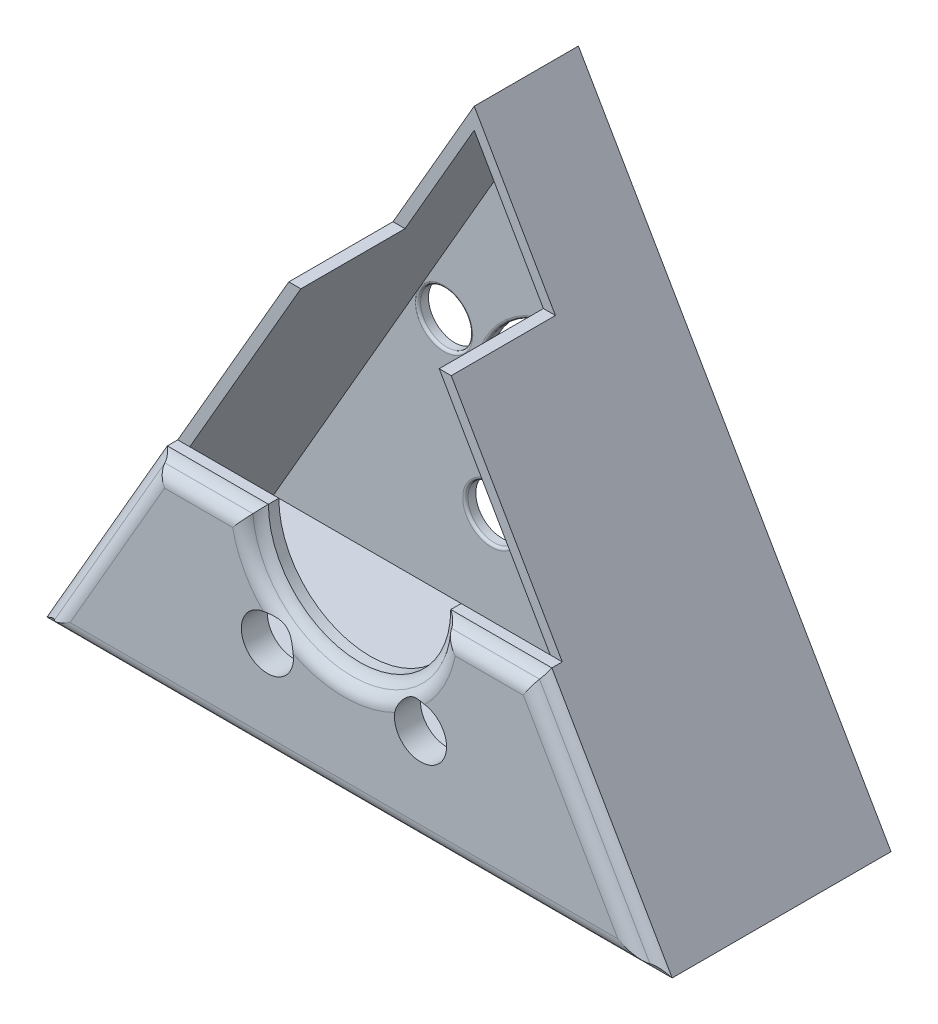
ISO-10303-21;
HEADER;
FILE_DESCRIPTION(('STEP AP214'),'2;1');
FILE_NAME('part.step','',(''),(''),'','','');
FILE_SCHEMA(('AUTOMOTIVE_DESIGN { 1 0 10303 214 1 1 1 1 }'));
ENDSEC;
DATA;
#1=APPLICATION_CONTEXT('core data for automotive mechanical design processes');
#2=APPLICATION_PROTOCOL_DEFINITION('international standard','automotive_design',2000,#1);
#3=PRODUCT_CONTEXT('',#1,'mechanical');
#4=PRODUCT('Part','Part','',(#3));
#5=PRODUCT_RELATED_PRODUCT_CATEGORY('part','',(#4));
#6=PRODUCT_DEFINITION_FORMATION('','',#4);
#7=PRODUCT_DEFINITION_CONTEXT('part definition',#1,'design');
#8=PRODUCT_DEFINITION('design','',#6,#7);
#9=PRODUCT_DEFINITION_SHAPE('','',#8);
#10=(LENGTH_UNIT() NAMED_UNIT(*) SI_UNIT(.MILLI.,.METRE.));
#11=(NAMED_UNIT(*) PLANE_ANGLE_UNIT() SI_UNIT($,.RADIAN.));
#12=(NAMED_UNIT(*) SI_UNIT($,.STERADIAN.) SOLID_ANGLE_UNIT());
#13=UNCERTAINTY_MEASURE_WITH_UNIT(LENGTH_MEASURE(1.E-05),#10,'distance_accuracy_value','');
#14=(GEOMETRIC_REPRESENTATION_CONTEXT(3) GLOBAL_UNCERTAINTY_ASSIGNED_CONTEXT((#13)) GLOBAL_UNIT_ASSIGNED_CONTEXT((#10,
#11,#12)) REPRESENTATION_CONTEXT('',''));
#15=CARTESIAN_POINT('',(0.,0.,0.));
#16=DIRECTION('',(0.,0.,1.));
#17=DIRECTION('',(1.,0.,0.));
#18=AXIS2_PLACEMENT_3D('',#15,#16,#17);
#19=CARTESIAN_POINT('',(96.9060360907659,40.,42.));
#20=DIRECTION('',(0.,-1.,0.));
#21=DIRECTION('',(1.,0.,0.));
#22=AXIS2_PLACEMENT_3D('',#19,#20,#21);
#23=PLANE('',#22);
#24=DIRECTION('',(-1.,0.,0.));
#25=VECTOR('',#24,1.);
#26=CARTESIAN_POINT('',(96.9060360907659,40.,42.));
#27=LINE('',#26,#25);
#28=CARTESIAN_POINT('',(42.500072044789,40.,42.));
#29=VERTEX_POINT('',#28);
#30=CARTESIAN_POINT('',(23.0941044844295,40.,42.));
#31=VERTEX_POINT('',#30);
#32=EDGE_CURVE('E232',#29,#31,#27,.T.);
#33=ORIENTED_EDGE('',*,*,#32,.F.);
#34=DIRECTION('',(0.,0.,-1.));
#35=VECTOR('',#34,1.);
#36=CARTESIAN_POINT('',(42.500072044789,40.,42.000025));
#37=LINE('',#36,#35);
#38=CARTESIAN_POINT('',(42.500072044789,40.,40.));
#39=VERTEX_POINT('',#38);
#40=EDGE_CURVE('E211',#29,#39,#37,.T.);
#41=ORIENTED_EDGE('',*,*,#40,.T.);
#42=DIRECTION('',(-1.,0.,0.));
#43=VECTOR('',#42,1.);
#44=CARTESIAN_POINT('',(96.9060360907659,40.,40.));
#45=LINE('',#44,#43);
#46=CARTESIAN_POINT('',(25.4035079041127,40.,40.));
#47=VERTEX_POINT('',#46);
#48=EDGE_CURVE('E245',#39,#47,#45,.T.);
#49=ORIENTED_EDGE('',*,*,#48,.T.);
#50=CARTESIAN_POINT('',(23.0941044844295,40.,40.));
#51=VERTEX_POINT('',#50);
#52=EDGE_CURVE('E250',#47,#51,#45,.T.);
#53=ORIENTED_EDGE('',*,*,#52,.T.);
#54=DIRECTION('',(0.,0.,-1.));
#55=VECTOR('',#54,1.);
#56=CARTESIAN_POINT('',(23.0941044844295,40.,42.));
#57=LINE('',#56,#55);
#58=EDGE_CURVE('E231',#31,#51,#57,.T.);
#59=ORIENTED_EDGE('',*,*,#58,.F.);
#60=EDGE_LOOP('',(#33,#41,#49,#53,#59));
#61=FACE_BOUND('',#60,.T.);
#62=ADVANCED_FACE('F35',(#61),#23,.F.);
#63=CARTESIAN_POINT('',(0.,0.,40.));
#64=DIRECTION('',(0.,0.,1.));
#65=DIRECTION('',(1.,0.,0.));
#66=AXIS2_PLACEMENT_3D('',#63,#64,#65);
#67=PLANE('',#66);
#68=DIRECTION('',(1.,0.,0.));
#69=VECTOR('',#68,1.);
#70=CARTESIAN_POINT('',(75.5885473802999,76.9230484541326,40.));
#71=LINE('',#70,#69);
#72=CARTESIAN_POINT('',(44.4117229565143,76.9230484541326,40.));
#73=VERTEX_POINT('',#72);
#74=CARTESIAN_POINT('',(46.7211263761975,76.9230484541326,40.));
#75=VERTEX_POINT('',#74);
#76=EDGE_CURVE('E667',#73,#75,#71,.T.);
#77=ORIENTED_EDGE('',*,*,#76,.F.);
#78=DIRECTION('',(-0.500001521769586,-0.866024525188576,0.));
#79=VECTOR('',#78,1.);
#80=CARTESIAN_POINT('',(0.,0.,40.));
#81=LINE('',#80,#79);
#82=EDGE_CURVE('E264',#73,#51,#81,.T.);
#83=ORIENTED_EDGE('',*,*,#82,.T.);
#84=ORIENTED_EDGE('',*,*,#52,.F.);
#85=DIRECTION('',(-0.500001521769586,-0.866024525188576,0.));
#86=VECTOR('',#85,1.);
#87=CARTESIAN_POINT('',(1.73204905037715,-1.00000304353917,40.));
#88=LINE('',#87,#86);
#89=EDGE_CURVE('E312',#75,#47,#88,.T.);
#90=ORIENTED_EDGE('',*,*,#89,.F.);
#91=EDGE_LOOP('',(#77,#83,#84,#90));
#92=FACE_BOUND('',#91,.T.);
#93=ADVANCED_FACE('F521',(#92),#67,.T.);
#94=CARTESIAN_POINT('',(0.,0.,40.));
#95=DIRECTION('',(0.866024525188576,-0.500001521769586,0.));
#96=DIRECTION('',(0.500001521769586,0.866024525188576,0.));
#97=AXIS2_PLACEMENT_3D('',#94,#95,#96);
#98=PLANE('',#97);
#99=ORIENTED_EDGE('',*,*,#82,.F.);
#100=DIRECTION('',(0.,0.,-1.));
#101=VECTOR('',#100,1.);
#102=CARTESIAN_POINT('',(44.4117229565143,76.9230484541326,40.));
#103=LINE('',#102,#101);
#104=CARTESIAN_POINT('',(44.4117229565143,76.9230484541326,20.));
#105=VERTEX_POINT('',#104);
#106=EDGE_CURVE('E361',#73,#105,#103,.T.);
#107=ORIENTED_EDGE('',*,*,#106,.T.);
#108=DIRECTION('',(-0.500001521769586,-0.866024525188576,0.));
#109=VECTOR('',#108,1.);
#110=CARTESIAN_POINT('',(0.,0.,20.));
#111=LINE('',#110,#109);
#112=CARTESIAN_POINT('',(60.0001826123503,103.922943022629,20.));
#113=VERTEX_POINT('',#112);
#114=EDGE_CURVE('E357',#113,#105,#111,.T.);
#115=ORIENTED_EDGE('',*,*,#114,.F.);
#116=DIRECTION('',(0.,0.,-1.));
#117=VECTOR('',#116,1.);
#118=CARTESIAN_POINT('',(60.0001826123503,103.922943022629,40.));
#119=LINE('',#118,#117);
#120=CARTESIAN_POINT('',(60.0001826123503,103.922943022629,0.));
#121=VERTEX_POINT('',#120);
#122=EDGE_CURVE('E280',#113,#121,#119,.T.);
#123=ORIENTED_EDGE('',*,*,#122,.T.);
#124=DIRECTION('',(-0.500001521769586,-0.866024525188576,0.));
#125=VECTOR('',#124,1.);
#126=CARTESIAN_POINT('',(0.,0.,0.));
#127=LINE('',#126,#125);
#128=CARTESIAN_POINT('',(0.,0.,0.));
#129=VERTEX_POINT('',#128);
#130=EDGE_CURVE('E276',#121,#129,#127,.T.);
#131=ORIENTED_EDGE('',*,*,#130,.T.);
#132=DIRECTION('',(0.,0.,-1.));
#133=VECTOR('',#132,1.);
#134=CARTESIAN_POINT('',(0.,0.,40.));
#135=LINE('',#134,#133);
#136=CARTESIAN_POINT('',(0.,0.,42.));
#137=VERTEX_POINT('',#136);
#138=EDGE_CURVE('E281',#137,#129,#135,.T.);
#139=ORIENTED_EDGE('',*,*,#138,.F.);
#140=DIRECTION('',(-0.500001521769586,-0.866024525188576,0.));
#141=VECTOR('',#140,1.);
#142=CARTESIAN_POINT('',(23.0941044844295,40.,42.));
#143=LINE('',#142,#141);
#144=EDGE_CURVE('E255',#31,#137,#143,.T.);
#145=ORIENTED_EDGE('',*,*,#144,.F.);
#146=ORIENTED_EDGE('',*,*,#58,.T.);
#147=EDGE_LOOP('',(#99,#107,#115,#123,#131,#139,#145,#146));
#148=FACE_BOUND('',#147,.T.);
#149=ADVANCED_FACE('F381',(#148),#98,.F.);
#150=CARTESIAN_POINT('',(0.,0.,40.));
#151=DIRECTION('',(0.,1.,0.));
#152=DIRECTION('',(0.,0.,1.));
#153=AXIS2_PLACEMENT_3D('',#150,#151,#152);
#154=PLANE('',#153);
#155=DIRECTION('',(1.,0.,0.));
#156=VECTOR('',#155,1.);
#157=CARTESIAN_POINT('',(0.,0.,0.));
#158=LINE('',#157,#156);
#159=CARTESIAN_POINT('',(120.,0.,0.));
#160=VERTEX_POINT('',#159);
#161=EDGE_CURVE('E289',#129,#160,#158,.T.);
#162=ORIENTED_EDGE('',*,*,#161,.T.);
#163=DIRECTION('',(0.,0.,-1.));
#164=VECTOR('',#163,1.);
#165=CARTESIAN_POINT('',(120.,0.,40.));
#166=LINE('',#165,#164);
#167=CARTESIAN_POINT('',(120.,0.,42.));
#168=VERTEX_POINT('',#167);
#169=EDGE_CURVE('E284',#168,#160,#166,.T.);
#170=ORIENTED_EDGE('',*,*,#169,.F.);
#171=DIRECTION('',(1.,0.,0.));
#172=VECTOR('',#171,1.);
#173=CARTESIAN_POINT('',(0.,0.,42.));
#174=LINE('',#173,#172);
#175=EDGE_CURVE('E365',#137,#168,#174,.T.);
#176=ORIENTED_EDGE('',*,*,#175,.F.);
#177=ORIENTED_EDGE('',*,*,#138,.T.);
#178=EDGE_LOOP('',(#162,#170,#176,#177));
#179=FACE_BOUND('',#178,.T.);
#180=ADVANCED_FACE('F378',(#179),#154,.F.);
#181=CARTESIAN_POINT('',(120.,0.,40.));
#182=DIRECTION('',(-0.866025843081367,-0.499999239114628,0.));
#183=DIRECTION('',(0.499999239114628,-0.866025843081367,0.));
#184=AXIS2_PLACEMENT_3D('',#181,#182,#183);
#185=PLANE('',#184);
#186=DIRECTION('',(-0.499999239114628,0.866025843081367,0.));
#187=VECTOR('',#186,1.);
#188=CARTESIAN_POINT('',(120.,0.,20.));
#189=LINE('',#188,#187);
#190=CARTESIAN_POINT('',(75.5885473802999,76.9230484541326,20.));
#191=VERTEX_POINT('',#190);
#192=EDGE_CURVE('E342',#191,#113,#189,.T.);
#193=ORIENTED_EDGE('',*,*,#192,.F.);
#194=DIRECTION('',(0.,0.,1.));
#195=VECTOR('',#194,1.);
#196=CARTESIAN_POINT('',(75.5885473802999,76.9230484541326,20.));
#197=LINE('',#196,#195);
#198=CARTESIAN_POINT('',(75.5885473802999,76.9230484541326,40.));
#199=VERTEX_POINT('',#198);
#200=EDGE_CURVE('E340',#191,#199,#197,.T.);
#201=ORIENTED_EDGE('',*,*,#200,.T.);
#202=DIRECTION('',(-0.499999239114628,0.866025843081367,0.));
#203=VECTOR('',#202,1.);
#204=CARTESIAN_POINT('',(120.,0.,40.));
#205=LINE('',#204,#203);
#206=CARTESIAN_POINT('',(96.9060360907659,40.,40.));
#207=VERTEX_POINT('',#206);
#208=EDGE_CURVE('E266',#207,#199,#205,.T.);
#209=ORIENTED_EDGE('',*,*,#208,.F.);
#210=DIRECTION('',(0.,0.,-1.));
#211=VECTOR('',#210,1.);
#212=CARTESIAN_POINT('',(96.9060360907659,40.,42.));
#213=LINE('',#212,#211);
#214=CARTESIAN_POINT('',(96.9060360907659,40.,42.));
#215=VERTEX_POINT('',#214);
#216=EDGE_CURVE('E235',#215,#207,#213,.T.);
#217=ORIENTED_EDGE('',*,*,#216,.F.);
#218=DIRECTION('',(-0.499999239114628,0.866025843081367,0.));
#219=VECTOR('',#218,1.);
#220=CARTESIAN_POINT('',(120.,0.,42.));
#221=LINE('',#220,#219);
#222=EDGE_CURVE('E238',#168,#215,#221,.T.);
#223=ORIENTED_EDGE('',*,*,#222,.F.);
#224=ORIENTED_EDGE('',*,*,#169,.T.);
#225=DIRECTION('',(-0.499999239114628,0.866025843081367,0.));
#226=VECTOR('',#225,1.);
#227=CARTESIAN_POINT('',(120.,0.,0.));
#228=LINE('',#227,#226);
#229=EDGE_CURVE('E267',#160,#121,#228,.T.);
#230=ORIENTED_EDGE('',*,*,#229,.T.);
#231=ORIENTED_EDGE('',*,*,#122,.F.);
#232=EDGE_LOOP('',(#193,#201,#209,#217,#223,#224,#230,#231));
#233=FACE_BOUND('',#232,.T.);
#234=ADVANCED_FACE('F337',(#233),#185,.F.);
#235=CARTESIAN_POINT('',(73.2791474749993,76.9230484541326,40.));
#236=VERTEX_POINT('',#235);
#237=EDGE_CURVE('E354',#236,#199,#71,.T.);
#238=ORIENTED_EDGE('',*,*,#237,.F.);
#239=DIRECTION('',(-0.499999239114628,0.866025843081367,0.));
#240=VECTOR('',#239,1.);
#241=CARTESIAN_POINT('',(118.267948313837,-0.999998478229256,40.));
#242=LINE('',#241,#240);
#243=CARTESIAN_POINT('',(94.5966361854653,40.,40.));
#244=VERTEX_POINT('',#243);
#245=EDGE_CURVE('E316',#244,#236,#242,.T.);
#246=ORIENTED_EDGE('',*,*,#245,.F.);
#247=EDGE_CURVE('E244',#207,#244,#45,.T.);
#248=ORIENTED_EDGE('',*,*,#247,.F.);
#249=ORIENTED_EDGE('',*,*,#208,.T.);
#250=EDGE_LOOP('',(#238,#246,#248,#249));
#251=FACE_BOUND('',#250,.T.);
#252=ADVANCED_FACE('F333',(#251),#67,.T.);
#253=CARTESIAN_POINT('',(0.,0.,0.));
#254=DIRECTION('',(0.,0.,1.));
#255=DIRECTION('',(1.,0.,0.));
#256=AXIS2_PLACEMENT_3D('',#253,#254,#255);
#257=PLANE('',#256);
#258=CARTESIAN_POINT('',(36.2236933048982,47.7255300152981,0.));
#259=DIRECTION('',(0.,0.,-1.));
#260=DIRECTION('',(-0.309016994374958,-0.95105651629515,0.));
#261=AXIS2_PLACEMENT_3D('',#258,#259,#260);
#262=CIRCLE('',#261,5.);
#263=CARTESIAN_POINT('',(34.6786083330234,42.9702474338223,0.));
#264=VERTEX_POINT('',#263);
#265=EDGE_CURVE('E644',#264,#264,#262,.T.);
#266=ORIENTED_EDGE('',*,*,#265,.F.);
#267=EDGE_LOOP('',(#266));
#268=FACE_BOUND('',#267,.T.);
#269=CARTESIAN_POINT('',(45.3053512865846,19.7746401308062,0.));
#270=DIRECTION('',(0.,0.,-1.));
#271=DIRECTION('',(0.809016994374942,-0.58778525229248,0.));
#272=AXIS2_PLACEMENT_3D('',#269,#270,#271);
#273=CIRCLE('',#272,5.);
#274=CARTESIAN_POINT('',(49.3504362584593,16.8357138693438,0.));
#275=VERTEX_POINT('',#274);
#276=EDGE_CURVE('E645',#275,#275,#273,.T.);
#277=ORIENTED_EDGE('',*,*,#276,.F.);
#278=EDGE_LOOP('',(#277));
#279=FACE_BOUND('',#278,.T.);
#280=CARTESIAN_POINT('',(74.6946139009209,19.7745101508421,0.));
#281=DIRECTION('',(0.,0.,-1.));
#282=DIRECTION('',(0.809016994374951,0.587785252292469,0.));
#283=AXIS2_PLACEMENT_3D('',#280,#281,#282);
#284=CIRCLE('',#283,5.);
#285=CARTESIAN_POINT('',(78.7396988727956,22.7134364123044,0.));
#286=VERTEX_POINT('',#285);
#287=EDGE_CURVE('E649',#286,#286,#284,.T.);
#288=ORIENTED_EDGE('',*,*,#287,.F.);
#289=EDGE_LOOP('',(#288));
#290=FACE_BOUND('',#289,.T.);
#291=CARTESIAN_POINT('',(83.7765191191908,47.7253197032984,0.));
#292=DIRECTION('',(0.,0.,-1.));
#293=DIRECTION('',(-0.309016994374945,0.951056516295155,0.));
#294=AXIS2_PLACEMENT_3D('',#291,#292,#293);
#295=CIRCLE('',#294,5.);
#296=CARTESIAN_POINT('',(82.2314341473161,52.4806022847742,0.));
#297=VERTEX_POINT('',#296);
#298=EDGE_CURVE('E658',#297,#297,#295,.T.);
#299=ORIENTED_EDGE('',*,*,#298,.F.);
#300=EDGE_LOOP('',(#299));
#301=FACE_BOUND('',#300,.T.);
#302=CARTESIAN_POINT('',(60.0001826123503,64.9999999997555,0.));
#303=DIRECTION('',(0.,0.,-1.));
#304=DIRECTION('',(-1.,0.,0.));
#305=AXIS2_PLACEMENT_3D('',#302,#303,#304);
#306=CIRCLE('',#305,5.);
#307=CARTESIAN_POINT('',(55.0001826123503,64.9999999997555,0.));
#308=VERTEX_POINT('',#307);
#309=EDGE_CURVE('E661',#308,#308,#306,.T.);
#310=ORIENTED_EDGE('',*,*,#309,.F.);
#311=EDGE_LOOP('',(#310));
#312=FACE_BOUND('',#311,.T.);
#313=CARTESIAN_POINT('',(60.000072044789,40.,0.));
#314=DIRECTION('',(0.,0.,-1.));
#315=DIRECTION('',(-1.,0.,0.));
#316=AXIS2_PLACEMENT_3D('',#313,#314,#315);
#317=CIRCLE('',#316,17.5);
#318=CARTESIAN_POINT('',(42.500072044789,40.,0.));
#319=VERTEX_POINT('',#318);
#320=EDGE_CURVE('E226',#319,#319,#317,.T.);
#321=ORIENTED_EDGE('',*,*,#320,.F.);
#322=EDGE_LOOP('',(#321));
#323=FACE_BOUND('',#322,.T.);
#324=ORIENTED_EDGE('',*,*,#130,.F.);
#325=ORIENTED_EDGE('',*,*,#229,.F.);
#326=ORIENTED_EDGE('',*,*,#161,.F.);
#327=EDGE_LOOP('',(#324,#325,#326));
#328=FACE_BOUND('',#327,.T.);
#329=ADVANCED_FACE('F377',(#268,#279,#290,#301,#312,#323,#328),#257,.F.);
#330=CARTESIAN_POINT('',(1.73204905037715,-1.00000304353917,40.));
#331=DIRECTION('',(0.866024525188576,-0.500001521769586,0.));
#332=DIRECTION('',(0.500001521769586,0.866024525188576,0.));
#333=AXIS2_PLACEMENT_3D('',#330,#331,#332);
#334=PLANE('',#333);
#335=DIRECTION('',(0.,0.,-1.));
#336=VECTOR('',#335,1.);
#337=CARTESIAN_POINT('',(46.7211263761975,76.9230484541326,40.));
#338=LINE('',#337,#336);
#339=CARTESIAN_POINT('',(46.7211263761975,76.9230484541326,20.));
#340=VERTEX_POINT('',#339);
#341=EDGE_CURVE('E359',#75,#340,#338,.T.);
#342=ORIENTED_EDGE('',*,*,#341,.F.);
#343=ORIENTED_EDGE('',*,*,#89,.T.);
#344=CARTESIAN_POINT('',(3.46410864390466,2.,40.));
#345=VERTEX_POINT('',#344);
#346=EDGE_CURVE('E311',#47,#345,#88,.T.);
#347=ORIENTED_EDGE('',*,*,#346,.T.);
#348=DIRECTION('',(0.,0.,-1.));
#349=VECTOR('',#348,1.);
#350=CARTESIAN_POINT('',(3.46410864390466,2.,40.));
#351=LINE('',#350,#349);
#352=CARTESIAN_POINT('',(3.46410864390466,2.,2.));
#353=VERTEX_POINT('',#352);
#354=EDGE_CURVE('E292',#345,#353,#351,.T.);
#355=ORIENTED_EDGE('',*,*,#354,.T.);
#356=DIRECTION('',(-0.500001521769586,-0.866024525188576,0.));
#357=VECTOR('',#356,1.);
#358=CARTESIAN_POINT('',(1.73204905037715,-1.00000304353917,2.));
#359=LINE('',#358,#357);
#360=CARTESIAN_POINT('',(60.0001773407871,99.9229460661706,2.));
#361=VERTEX_POINT('',#360);
#362=EDGE_CURVE('E246',#361,#353,#359,.T.);
#363=ORIENTED_EDGE('',*,*,#362,.F.);
#364=DIRECTION('',(0.,0.,-1.));
#365=VECTOR('',#364,1.);
#366=CARTESIAN_POINT('',(60.0001773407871,99.9229460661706,40.));
#367=LINE('',#366,#365);
#368=CARTESIAN_POINT('',(60.0001773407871,99.9229460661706,20.));
#369=VERTEX_POINT('',#368);
#370=EDGE_CURVE('E302',#369,#361,#367,.T.);
#371=ORIENTED_EDGE('',*,*,#370,.F.);
#372=DIRECTION('',(-0.500001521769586,-0.866024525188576,0.));
#373=VECTOR('',#372,1.);
#374=CARTESIAN_POINT('',(1.73204905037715,-1.00000304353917,20.));
#375=LINE('',#374,#373);
#376=EDGE_CURVE('E345',#369,#340,#375,.T.);
#377=ORIENTED_EDGE('',*,*,#376,.T.);
#378=EDGE_LOOP('',(#342,#343,#347,#355,#363,#371,#377));
#379=FACE_BOUND('',#378,.T.);
#380=ADVANCED_FACE('F508',(#379),#334,.T.);
#381=CARTESIAN_POINT('',(0.,2.,40.));
#382=DIRECTION('',(0.,1.,0.));
#383=DIRECTION('',(0.,0.,1.));
#384=AXIS2_PLACEMENT_3D('',#381,#382,#383);
#385=PLANE('',#384);
#386=DIRECTION('',(1.,0.,0.));
#387=VECTOR('',#386,1.);
#388=CARTESIAN_POINT('',(0.,2.,2.));
#389=LINE('',#388,#387);
#390=CARTESIAN_POINT('',(116.535901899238,2.,2.));
#391=VERTEX_POINT('',#390);
#392=EDGE_CURVE('E306',#353,#391,#389,.T.);
#393=ORIENTED_EDGE('',*,*,#392,.F.);
#394=ORIENTED_EDGE('',*,*,#354,.F.);
#395=DIRECTION('',(1.,0.,0.));
#396=VECTOR('',#395,1.);
#397=CARTESIAN_POINT('',(0.,2.,40.));
#398=LINE('',#397,#396);
#399=CARTESIAN_POINT('',(116.535901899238,2.,40.));
#400=VERTEX_POINT('',#399);
#401=EDGE_CURVE('E314',#345,#400,#398,.T.);
#402=ORIENTED_EDGE('',*,*,#401,.T.);
#403=DIRECTION('',(0.,0.,-1.));
#404=VECTOR('',#403,1.);
#405=CARTESIAN_POINT('',(116.535901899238,2.,40.));
#406=LINE('',#405,#404);
#407=EDGE_CURVE('E296',#400,#391,#406,.T.);
#408=ORIENTED_EDGE('',*,*,#407,.T.);
#409=EDGE_LOOP('',(#393,#394,#402,#408));
#410=FACE_BOUND('',#409,.T.);
#411=ADVANCED_FACE('F511',(#410),#385,.T.);
#412=CARTESIAN_POINT('',(118.267948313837,-0.999998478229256,40.));
#413=DIRECTION('',(-0.866025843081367,-0.499999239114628,0.));
#414=DIRECTION('',(0.499999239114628,-0.866025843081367,0.));
#415=AXIS2_PLACEMENT_3D('',#412,#413,#414);
#416=PLANE('',#415);
#417=DIRECTION('',(0.,0.,1.));
#418=VECTOR('',#417,1.);
#419=CARTESIAN_POINT('',(73.2791474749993,76.9230484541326,40.));
#420=LINE('',#419,#418);
#421=CARTESIAN_POINT('',(73.2791474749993,76.9230484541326,20.));
#422=VERTEX_POINT('',#421);
#423=EDGE_CURVE('E214',#422,#236,#420,.T.);
#424=ORIENTED_EDGE('',*,*,#423,.F.);
#425=DIRECTION('',(-0.499999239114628,0.866025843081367,0.));
#426=VECTOR('',#425,1.);
#427=CARTESIAN_POINT('',(118.267948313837,-0.999998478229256,20.));
#428=LINE('',#427,#426);
#429=EDGE_CURVE('E260',#422,#369,#428,.T.);
#430=ORIENTED_EDGE('',*,*,#429,.T.);
#431=ORIENTED_EDGE('',*,*,#370,.T.);
#432=DIRECTION('',(-0.499999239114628,0.866025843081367,0.));
#433=VECTOR('',#432,1.);
#434=CARTESIAN_POINT('',(118.267948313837,-0.999998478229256,2.));
#435=LINE('',#434,#433);
#436=EDGE_CURVE('E307',#391,#361,#435,.T.);
#437=ORIENTED_EDGE('',*,*,#436,.F.);
#438=ORIENTED_EDGE('',*,*,#407,.F.);
#439=EDGE_CURVE('E272',#400,#244,#242,.T.);
#440=ORIENTED_EDGE('',*,*,#439,.T.);
#441=ORIENTED_EDGE('',*,*,#245,.T.);
#442=EDGE_LOOP('',(#424,#430,#431,#437,#438,#440,#441));
#443=FACE_BOUND('',#442,.T.);
#444=ADVANCED_FACE('F324',(#443),#416,.T.);
#445=CARTESIAN_POINT('',(0.,0.,2.));
#446=DIRECTION('',(0.,0.,1.));
#447=DIRECTION('',(1.,0.,0.));
#448=AXIS2_PLACEMENT_3D('',#445,#446,#447);
#449=PLANE('',#448);
#450=CARTESIAN_POINT('',(60.000072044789,40.,2.));
#451=DIRECTION('',(0.,0.,1.));
#452=DIRECTION('',(1.,0.,0.));
#453=AXIS2_PLACEMENT_3D('',#450,#451,#452);
#454=CIRCLE('',#453,18.);
#455=CARTESIAN_POINT('',(78.000072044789,40.,2.));
#456=VERTEX_POINT('',#455);
#457=EDGE_CURVE('E630',#456,#456,#454,.F.);
#458=ORIENTED_EDGE('',*,*,#457,.T.);
#459=EDGE_LOOP('',(#458));
#460=FACE_BOUND('',#459,.T.);
#461=CARTESIAN_POINT('',(83.7765191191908,47.7253197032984,2.));
#462=DIRECTION('',(0.,0.,1.));
#463=DIRECTION('',(1.,0.,0.));
#464=AXIS2_PLACEMENT_3D('',#461,#462,#463);
#465=CIRCLE('',#464,5.5);
#466=CARTESIAN_POINT('',(89.2765191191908,47.7253197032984,2.));
#467=VERTEX_POINT('',#466);
#468=EDGE_CURVE('E627',#467,#467,#465,.F.);
#469=ORIENTED_EDGE('',*,*,#468,.T.);
#470=EDGE_LOOP('',(#469));
#471=FACE_BOUND('',#470,.T.);
#472=CARTESIAN_POINT('',(74.6946139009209,19.7745101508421,2.));
#473=DIRECTION('',(0.,0.,1.));
#474=DIRECTION('',(1.,0.,0.));
#475=AXIS2_PLACEMENT_3D('',#472,#473,#474);
#476=CIRCLE('',#475,5.5);
#477=CARTESIAN_POINT('',(80.1946139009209,19.7745101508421,2.));
#478=VERTEX_POINT('',#477);
#479=EDGE_CURVE('E618',#478,#478,#476,.F.);
#480=ORIENTED_EDGE('',*,*,#479,.T.);
#481=EDGE_LOOP('',(#480));
#482=FACE_BOUND('',#481,.T.);
#483=CARTESIAN_POINT('',(45.3053512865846,19.7746401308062,2.));
#484=DIRECTION('',(0.,0.,1.));
#485=DIRECTION('',(1.,0.,0.));
#486=AXIS2_PLACEMENT_3D('',#483,#484,#485);
#487=CIRCLE('',#486,5.5);
#488=CARTESIAN_POINT('',(50.8053512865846,19.7746401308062,2.));
#489=VERTEX_POINT('',#488);
#490=EDGE_CURVE('E614',#489,#489,#487,.F.);
#491=ORIENTED_EDGE('',*,*,#490,.T.);
#492=EDGE_LOOP('',(#491));
#493=FACE_BOUND('',#492,.T.);
#494=CARTESIAN_POINT('',(36.2236933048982,47.7255300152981,2.));
#495=DIRECTION('',(0.,0.,1.));
#496=DIRECTION('',(1.,0.,0.));
#497=AXIS2_PLACEMENT_3D('',#494,#495,#496);
#498=CIRCLE('',#497,5.5);
#499=CARTESIAN_POINT('',(41.7236933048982,47.7255300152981,2.));
#500=VERTEX_POINT('',#499);
#501=EDGE_CURVE('E612',#500,#500,#498,.F.);
#502=ORIENTED_EDGE('',*,*,#501,.T.);
#503=EDGE_LOOP('',(#502));
#504=FACE_BOUND('',#503,.T.);
#505=CARTESIAN_POINT('',(60.0001826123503,64.9999999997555,2.));
#506=DIRECTION('',(0.,0.,1.));
#507=DIRECTION('',(1.,0.,0.));
#508=AXIS2_PLACEMENT_3D('',#505,#506,#507);
#509=CIRCLE('',#508,5.5);
#510=CARTESIAN_POINT('',(65.5001826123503,64.9999999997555,2.));
#511=VERTEX_POINT('',#510);
#512=EDGE_CURVE('E615',#511,#511,#509,.F.);
#513=ORIENTED_EDGE('',*,*,#512,.T.);
#514=EDGE_LOOP('',(#513));
#515=FACE_BOUND('',#514,.T.);
#516=ORIENTED_EDGE('',*,*,#362,.T.);
#517=ORIENTED_EDGE('',*,*,#392,.T.);
#518=ORIENTED_EDGE('',*,*,#436,.T.);
#519=EDGE_LOOP('',(#516,#517,#518));
#520=FACE_BOUND('',#519,.T.);
#521=ADVANCED_FACE('F504',(#460,#471,#482,#493,#504,#515,#520),#449,.T.);
#522=CARTESIAN_POINT('',(0.,0.,40.));
#523=DIRECTION('',(0.,0.,-1.));
#524=DIRECTION('',(-1.,0.,0.));
#525=AXIS2_PLACEMENT_3D('',#522,#523,#524);
#526=PLANE('',#525);
#527=CARTESIAN_POINT('',(74.6946139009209,19.7745101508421,40.));
#528=DIRECTION('',(0.,0.,-1.));
#529=DIRECTION('',(-1.,0.,0.));
#530=AXIS2_PLACEMENT_3D('',#527,#528,#529);
#531=CIRCLE('',#530,5.);
#532=CARTESIAN_POINT('',(69.6946139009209,19.7745101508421,40.));
#533=VERTEX_POINT('',#532);
#534=EDGE_CURVE('E652',#533,#533,#531,.F.);
#535=ORIENTED_EDGE('',*,*,#534,.T.);
#536=EDGE_LOOP('',(#535));
#537=FACE_BOUND('',#536,.T.);
#538=CARTESIAN_POINT('',(45.3053512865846,19.7746401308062,40.));
#539=DIRECTION('',(0.,0.,-1.));
#540=DIRECTION('',(-1.,0.,0.));
#541=AXIS2_PLACEMENT_3D('',#538,#539,#540);
#542=CIRCLE('',#541,5.00000000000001);
#543=CARTESIAN_POINT('',(40.3053512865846,19.7746401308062,40.));
#544=VERTEX_POINT('',#543);
#545=EDGE_CURVE('E646',#544,#544,#542,.F.);
#546=ORIENTED_EDGE('',*,*,#545,.T.);
#547=EDGE_LOOP('',(#546));
#548=FACE_BOUND('',#547,.T.);
#549=CARTESIAN_POINT('',(60.000072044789,40.,40.));
#550=DIRECTION('',(0.,0.,-1.));
#551=DIRECTION('',(-1.,0.,0.));
#552=AXIS2_PLACEMENT_3D('',#549,#550,#551);
#553=CIRCLE('',#552,17.5);
#554=CARTESIAN_POINT('',(77.500072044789,40.,40.));
#555=VERTEX_POINT('',#554);
#556=EDGE_CURVE('E329',#555,#39,#553,.T.);
#557=ORIENTED_EDGE('',*,*,#556,.F.);
#558=EDGE_CURVE('E225',#244,#555,#45,.T.);
#559=ORIENTED_EDGE('',*,*,#558,.F.);
#560=ORIENTED_EDGE('',*,*,#439,.F.);
#561=ORIENTED_EDGE('',*,*,#401,.F.);
#562=ORIENTED_EDGE('',*,*,#346,.F.);
#563=ORIENTED_EDGE('',*,*,#48,.F.);
#564=EDGE_LOOP('',(#557,#559,#560,#561,#562,#563));
#565=FACE_BOUND('',#564,.T.);
#566=ADVANCED_FACE('F327',(#537,#548,#565),#526,.T.);
#567=ORIENTED_EDGE('',*,*,#558,.T.);
#568=DIRECTION('',(0.,0.,-1.));
#569=VECTOR('',#568,1.);
#570=CARTESIAN_POINT('',(77.500072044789,40.,42.000025));
#571=LINE('',#570,#569);
#572=CARTESIAN_POINT('',(77.500072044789,40.,42.));
#573=VERTEX_POINT('',#572);
#574=EDGE_CURVE('E208',#555,#573,#571,.F.);
#575=ORIENTED_EDGE('',*,*,#574,.T.);
#576=EDGE_CURVE('E221',#215,#573,#27,.T.);
#577=ORIENTED_EDGE('',*,*,#576,.F.);
#578=ORIENTED_EDGE('',*,*,#216,.T.);
#579=ORIENTED_EDGE('',*,*,#247,.T.);
#580=EDGE_LOOP('',(#567,#575,#577,#578,#579));
#581=FACE_BOUND('',#580,.T.);
#582=ADVANCED_FACE('F219',(#581),#23,.F.);
#583=CARTESIAN_POINT('',(75.5885473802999,76.9230484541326,20.));
#584=DIRECTION('',(0.,-1.,0.));
#585=DIRECTION('',(0.,0.,-1.));
#586=AXIS2_PLACEMENT_3D('',#583,#584,#585);
#587=PLANE('',#586);
#588=ORIENTED_EDGE('',*,*,#76,.T.);
#589=ORIENTED_EDGE('',*,*,#341,.T.);
#590=DIRECTION('',(1.,0.,0.));
#591=VECTOR('',#590,1.);
#592=CARTESIAN_POINT('',(75.5885473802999,76.9230484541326,20.));
#593=LINE('',#592,#591);
#594=EDGE_CURVE('E346',#105,#340,#593,.T.);
#595=ORIENTED_EDGE('',*,*,#594,.F.);
#596=ORIENTED_EDGE('',*,*,#106,.F.);
#597=EDGE_LOOP('',(#588,#589,#595,#596));
#598=FACE_BOUND('',#597,.T.);
#599=ADVANCED_FACE('F498',(#598),#587,.F.);
#600=CARTESIAN_POINT('',(0.,0.,20.));
#601=DIRECTION('',(0.,0.,1.));
#602=DIRECTION('',(1.,0.,0.));
#603=AXIS2_PLACEMENT_3D('',#600,#601,#602);
#604=PLANE('',#603);
#605=ORIENTED_EDGE('',*,*,#114,.T.);
#606=ORIENTED_EDGE('',*,*,#594,.T.);
#607=ORIENTED_EDGE('',*,*,#376,.F.);
#608=ORIENTED_EDGE('',*,*,#429,.F.);
#609=EDGE_CURVE('E351',#422,#191,#593,.T.);
#610=ORIENTED_EDGE('',*,*,#609,.T.);
#611=ORIENTED_EDGE('',*,*,#192,.T.);
#612=EDGE_LOOP('',(#605,#606,#607,#608,#610,#611));
#613=FACE_BOUND('',#612,.T.);
#614=ADVANCED_FACE('F495',(#613),#604,.T.);
#615=ORIENTED_EDGE('',*,*,#423,.T.);
#616=ORIENTED_EDGE('',*,*,#237,.T.);
#617=ORIENTED_EDGE('',*,*,#200,.F.);
#618=ORIENTED_EDGE('',*,*,#609,.F.);
#619=EDGE_LOOP('',(#615,#616,#617,#618));
#620=FACE_BOUND('',#619,.T.);
#621=ADVANCED_FACE('F494',(#620),#587,.F.);
#622=CARTESIAN_POINT('',(60.000072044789,40.,42.000025));
#623=DIRECTION('',(0.,0.,-1.));
#624=DIRECTION('',(-1.,0.,0.));
#625=AXIS2_PLACEMENT_3D('',#622,#623,#624);
#626=CYLINDRICAL_SURFACE('',#625,17.5);
#627=ORIENTED_EDGE('',*,*,#556,.T.);
#628=ORIENTED_EDGE('',*,*,#40,.F.);
#629=CARTESIAN_POINT('',(60.000072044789,40.,42.));
#630=DIRECTION('',(0.,0.,-1.));
#631=DIRECTION('',(-1.,0.,0.));
#632=AXIS2_PLACEMENT_3D('',#629,#630,#631);
#633=CIRCLE('',#632,17.5);
#634=EDGE_CURVE('E194',#573,#29,#633,.T.);
#635=ORIENTED_EDGE('',*,*,#634,.F.);
#636=ORIENTED_EDGE('',*,*,#574,.F.);
#637=EDGE_LOOP('',(#627,#628,#635,#636));
#638=FACE_BOUND('',#637,.T.);
#639=ADVANCED_FACE('F207',(#638),#626,.F.);
#640=CARTESIAN_POINT('',(60.000072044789,40.,1.5));
#641=DIRECTION('',(0.,0.,1.));
#642=DIRECTION('',(1.,0.,0.));
#643=AXIS2_PLACEMENT_3D('',#640,#641,#642);
#644=CIRCLE('',#643,17.5);
#645=CARTESIAN_POINT('',(77.500072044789,40.,1.5));
#646=VERTEX_POINT('',#645);
#647=EDGE_CURVE('E621',#646,#646,#644,.T.);
#648=ORIENTED_EDGE('',*,*,#647,.T.);
#649=EDGE_LOOP('',(#648));
#650=FACE_BOUND('',#649,.T.);
#651=ORIENTED_EDGE('',*,*,#320,.T.);
#652=EDGE_LOOP('',(#651));
#653=FACE_BOUND('',#652,.T.);
#654=ADVANCED_FACE('F490',(#650,#653),#626,.F.);
#655=CARTESIAN_POINT('',(60.0001826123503,64.9999999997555,42.001025));
#656=DIRECTION('',(0.,0.,-1.));
#657=DIRECTION('',(-1.,0.,0.));
#658=AXIS2_PLACEMENT_3D('',#655,#656,#657);
#659=CYLINDRICAL_SURFACE('',#658,5.);
#660=CARTESIAN_POINT('',(60.0001826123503,64.9999999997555,1.5));
#661=DIRECTION('',(0.,0.,1.));
#662=DIRECTION('',(1.,0.,0.));
#663=AXIS2_PLACEMENT_3D('',#660,#661,#662);
#664=CIRCLE('',#663,5.);
#665=CARTESIAN_POINT('',(65.0001826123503,64.9999999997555,1.5));
#666=VERTEX_POINT('',#665);
#667=EDGE_CURVE('E11',#666,#666,#664,.T.);
#668=ORIENTED_EDGE('',*,*,#667,.T.);
#669=EDGE_LOOP('',(#668));
#670=FACE_BOUND('',#669,.T.);
#671=ORIENTED_EDGE('',*,*,#309,.T.);
#672=EDGE_LOOP('',(#671));
#673=FACE_BOUND('',#672,.T.);
#674=ADVANCED_FACE('F486',(#670,#673),#659,.F.);
#675=CARTESIAN_POINT('',(83.7765191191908,47.7253197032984,42.001025));
#676=DIRECTION('',(0.,0.,-1.));
#677=DIRECTION('',(-1.,0.,0.));
#678=AXIS2_PLACEMENT_3D('',#675,#676,#677);
#679=CYLINDRICAL_SURFACE('',#678,5.);
#680=CARTESIAN_POINT('',(83.7765191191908,47.7253197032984,1.5));
#681=DIRECTION('',(0.,0.,1.));
#682=DIRECTION('',(1.,0.,0.));
#683=AXIS2_PLACEMENT_3D('',#680,#681,#682);
#684=CIRCLE('',#683,5.);
#685=CARTESIAN_POINT('',(88.7765191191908,47.7253197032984,1.5));
#686=VERTEX_POINT('',#685);
#687=EDGE_CURVE('E633',#686,#686,#684,.T.);
#688=ORIENTED_EDGE('',*,*,#687,.T.);
#689=EDGE_LOOP('',(#688));
#690=FACE_BOUND('',#689,.T.);
#691=ORIENTED_EDGE('',*,*,#298,.T.);
#692=EDGE_LOOP('',(#691));
#693=FACE_BOUND('',#692,.T.);
#694=ADVANCED_FACE('F482',(#690,#693),#679,.F.);
#695=CARTESIAN_POINT('',(74.6946139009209,19.7745101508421,42.001025));
#696=DIRECTION('',(0.,0.,-1.));
#697=DIRECTION('',(-1.,0.,0.));
#698=AXIS2_PLACEMENT_3D('',#695,#696,#697);
#699=CYLINDRICAL_SURFACE('',#698,5.);
#700=CARTESIAN_POINT('',(74.6946139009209,19.7745101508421,1.5));
#701=DIRECTION('',(0.,0.,1.));
#702=DIRECTION('',(1.,0.,0.));
#703=AXIS2_PLACEMENT_3D('',#700,#701,#702);
#704=CIRCLE('',#703,5.);
#705=CARTESIAN_POINT('',(79.6946139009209,19.7745101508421,1.5));
#706=VERTEX_POINT('',#705);
#707=EDGE_CURVE('E636',#706,#706,#704,.T.);
#708=ORIENTED_EDGE('',*,*,#707,.T.);
#709=EDGE_LOOP('',(#708));
#710=FACE_BOUND('',#709,.T.);
#711=ORIENTED_EDGE('',*,*,#287,.T.);
#712=EDGE_LOOP('',(#711));
#713=FACE_BOUND('',#712,.T.);
#714=ADVANCED_FACE('F478',(#710,#713),#699,.F.);
#715=CARTESIAN_POINT('',(45.3053512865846,19.7746401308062,42.001025));
#716=DIRECTION('',(0.,0.,-1.));
#717=DIRECTION('',(-1.,0.,0.));
#718=AXIS2_PLACEMENT_3D('',#715,#716,#717);
#719=CYLINDRICAL_SURFACE('',#718,5.);
#720=CARTESIAN_POINT('',(45.3053512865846,19.7746401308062,1.5));
#721=DIRECTION('',(0.,0.,1.));
#722=DIRECTION('',(1.,0.,0.));
#723=AXIS2_PLACEMENT_3D('',#720,#721,#722);
#724=CIRCLE('',#723,5.);
#725=CARTESIAN_POINT('',(50.3053512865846,19.7746401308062,1.5));
#726=VERTEX_POINT('',#725);
#727=EDGE_CURVE('E639',#726,#726,#724,.T.);
#728=ORIENTED_EDGE('',*,*,#727,.T.);
#729=EDGE_LOOP('',(#728));
#730=FACE_BOUND('',#729,.T.);
#731=ORIENTED_EDGE('',*,*,#276,.T.);
#732=EDGE_LOOP('',(#731));
#733=FACE_BOUND('',#732,.T.);
#734=ADVANCED_FACE('F474',(#730,#733),#719,.F.);
#735=CARTESIAN_POINT('',(36.2236933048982,47.7255300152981,42.001025));
#736=DIRECTION('',(0.,0.,-1.));
#737=DIRECTION('',(-1.,0.,0.));
#738=AXIS2_PLACEMENT_3D('',#735,#736,#737);
#739=CYLINDRICAL_SURFACE('',#738,5.);
#740=CARTESIAN_POINT('',(36.2236933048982,47.7255300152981,1.5));
#741=DIRECTION('',(0.,0.,1.));
#742=DIRECTION('',(1.,0.,0.));
#743=AXIS2_PLACEMENT_3D('',#740,#741,#742);
#744=CIRCLE('',#743,5.);
#745=CARTESIAN_POINT('',(41.2236933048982,47.7255300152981,1.5));
#746=VERTEX_POINT('',#745);
#747=EDGE_CURVE('E43',#746,#746,#744,.T.);
#748=ORIENTED_EDGE('',*,*,#747,.T.);
#749=EDGE_LOOP('',(#748));
#750=FACE_BOUND('',#749,.T.);
#751=ORIENTED_EDGE('',*,*,#265,.T.);
#752=EDGE_LOOP('',(#751));
#753=FACE_BOUND('',#752,.T.);
#754=ADVANCED_FACE('F470',(#750,#753),#739,.F.);
#755=CARTESIAN_POINT('',(45.3053512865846,19.7746401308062,-0.001000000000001));
#756=DIRECTION('',(0.,0.,1.));
#757=DIRECTION('',(1.,0.,0.));
#758=AXIS2_PLACEMENT_3D('',#755,#756,#757);
#759=CYLINDRICAL_SURFACE('',#758,5.00000000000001);
#760=ORIENTED_EDGE('',*,*,#545,.F.);
#761=EDGE_LOOP('',(#760));
#762=FACE_BOUND('',#761,.T.);
#763=CARTESIAN_POINT('',(45.3053512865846,19.7746401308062,45.));
#764=DIRECTION('',(0.,0.,1.));
#765=DIRECTION('',(1.,0.,0.));
#766=AXIS2_PLACEMENT_3D('',#763,#764,#765);
#767=CIRCLE('',#766,5.00000000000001);
#768=CARTESIAN_POINT('',(50.2508346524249,20.5109785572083,45.));
#769=VERTEX_POINT('',#768);
#770=CARTESIAN_POINT('',(44.4774559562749,24.7056227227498,45.));
#771=VERTEX_POINT('',#770);
#772=EDGE_CURVE('E201',#769,#771,#767,.F.);
#773=ORIENTED_EDGE('',*,*,#772,.F.);
#774=CARTESIAN_POINT('',(50.2508346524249,20.5109785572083,45.));
#775=CARTESIAN_POINT('',(50.2319083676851,20.6382979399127,45.0000092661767));
#776=CARTESIAN_POINT('',(50.2080351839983,20.7646962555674,44.9944505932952));
#777=CARTESIAN_POINT('',(50.1509172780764,21.0142980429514,44.9743921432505));
#778=CARTESIAN_POINT('',(50.1176981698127,21.1375092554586,44.9599166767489));
#779=CARTESIAN_POINT('',(50.04236592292,21.3798839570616,44.9242257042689));
#780=CARTESIAN_POINT('',(50.0002677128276,21.4990538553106,44.9030214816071));
#781=CARTESIAN_POINT('',(49.9075328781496,21.7331557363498,44.8559709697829));
#782=CARTESIAN_POINT('',(49.8568897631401,21.8480844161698,44.830121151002));
#783=CARTESIAN_POINT('',(49.740594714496,22.0873096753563,44.7725146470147));
#784=CARTESIAN_POINT('',(49.6738600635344,22.2109982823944,44.7404230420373));
#785=CARTESIAN_POINT('',(49.5302609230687,22.4522980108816,44.6760318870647));
#786=CARTESIAN_POINT('',(49.4533956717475,22.5699086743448,44.6437323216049));
#787=CARTESIAN_POINT('',(49.2897627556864,22.7985778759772,44.5820801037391));
#788=CARTESIAN_POINT('',(49.2030110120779,22.9096465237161,44.5527228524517));
#789=CARTESIAN_POINT('',(49.0196449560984,23.1248604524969,44.5000922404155));
#790=CARTESIAN_POINT('',(48.9230357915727,23.2290093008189,44.4768157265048));
#791=CARTESIAN_POINT('',(48.7455300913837,23.4046067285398,44.4439359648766));
#792=CARTESIAN_POINT('',(48.6666795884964,23.4777588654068,44.4323732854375));
#793=CARTESIAN_POINT('',(48.5040411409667,23.6191145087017,44.4152915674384));
#794=CARTESIAN_POINT('',(48.4202541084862,23.6873189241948,44.4097714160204));
#795=CARTESIAN_POINT('',(48.2484547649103,23.818126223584,44.4052708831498));
#796=CARTESIAN_POINT('',(48.1604493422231,23.8807377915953,44.4062801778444));
#797=CARTESIAN_POINT('',(47.9807851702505,24.0000019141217,44.4147215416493));
#798=CARTESIAN_POINT('',(47.8891261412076,24.0566540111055,44.4221541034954));
#799=CARTESIAN_POINT('',(47.7034311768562,24.163331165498,44.4427300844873));
#800=CARTESIAN_POINT('',(47.6094137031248,24.2133954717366,44.4558374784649));
#801=CARTESIAN_POINT('',(47.4189886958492,24.3071683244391,44.4867228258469));
#802=CARTESIAN_POINT('',(47.3225800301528,24.3508737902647,44.5045030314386));
#803=CARTESIAN_POINT('',(47.0297834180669,24.4726309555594,44.5631128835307));
#804=CARTESIAN_POINT('',(46.8303398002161,24.5410294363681,44.6091422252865));
#805=CARTESIAN_POINT('',(46.5073043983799,24.6296324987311,44.6851146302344));
#806=CARTESIAN_POINT('',(46.3856291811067,24.6581429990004,44.714041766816));
#807=CARTESIAN_POINT('',(46.1402501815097,24.7060289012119,44.7708855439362));
#808=CARTESIAN_POINT('',(46.0165458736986,24.7254018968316,44.7988019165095));
#809=CARTESIAN_POINT('',(45.6437702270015,24.7694100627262,44.8776346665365));
#810=CARTESIAN_POINT('',(45.3917180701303,24.7802977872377,44.923989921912));
#811=CARTESIAN_POINT('',(45.0285704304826,24.7681903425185,44.9695584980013));
#812=CARTESIAN_POINT('',(44.9182905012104,24.7608625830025,44.9806094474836));
#813=CARTESIAN_POINT('',(44.6976691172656,24.7388190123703,44.9958403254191));
#814=CARTESIAN_POINT('',(44.5873284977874,24.7240807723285,44.9999992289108));
#815=CARTESIAN_POINT('',(44.4774559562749,24.7056227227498,45.));
#816=B_SPLINE_CURVE_WITH_KNOTS('',3,(#774,#775,#776,#777,#778,#779,#780,#781,#782,#783,#784,
#785,#786,#787,#788,#789,#790,#791,#792,#793,#794,#795,#796,#797,#798,#799,#800,#801,#802,#803,
#804,#805,#806,#807,#808,#809,#810,#811,#812,#813,#814,#815),.UNSPECIFIED.,.F.,.F.,(4,2,2,2,2,2,
2,2,2,2,2,2,2,2,2,2,2,2,2,2,4),(0.,0.385675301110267,0.770303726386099,1.15429055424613,
1.53857036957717,1.97055001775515,2.40256216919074,2.83388818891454,3.2649900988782,
3.58916649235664,3.91328317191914,4.23688750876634,4.56051667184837,4.88212081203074,
5.20388024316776,5.84917364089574,6.2337055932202,6.61833875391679,7.38340439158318,
7.71623600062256,8.05008109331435),.UNSPECIFIED.);
#817=EDGE_CURVE('E452',#769,#771,#816,.T.);
#818=ORIENTED_EDGE('',*,*,#817,.T.);
#819=EDGE_LOOP('',(#773,#818));
#820=FACE_BOUND('',#819,.T.);
#821=ADVANCED_FACE('F465',(#762,#820),#759,.F.);
#822=CARTESIAN_POINT('',(74.6946139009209,19.7745101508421,-0.001000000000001));
#823=DIRECTION('',(0.,0.,1.));
#824=DIRECTION('',(1.,0.,0.));
#825=AXIS2_PLACEMENT_3D('',#822,#823,#824);
#826=CYLINDRICAL_SURFACE('',#825,5.);
#827=ORIENTED_EDGE('',*,*,#534,.F.);
#828=EDGE_LOOP('',(#827));
#829=FACE_BOUND('',#828,.T.);
#830=CARTESIAN_POINT('',(74.6946139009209,19.7745101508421,45.));
#831=DIRECTION('',(0.,0.,1.));
#832=DIRECTION('',(1.,0.,0.));
#833=AXIS2_PLACEMENT_3D('',#830,#831,#832);
#834=CIRCLE('',#833,5.);
#835=CARTESIAN_POINT('',(75.5225528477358,24.7054854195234,45.));
#836=VERTEX_POINT('',#835);
#837=CARTESIAN_POINT('',(69.7491370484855,20.5108923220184,45.));
#838=VERTEX_POINT('',#837);
#839=EDGE_CURVE('E975',#836,#838,#834,.F.);
#840=ORIENTED_EDGE('',*,*,#839,.F.);
#841=CARTESIAN_POINT('',(75.5225528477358,24.7054854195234,45.));
#842=CARTESIAN_POINT('',(75.3956163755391,24.7268293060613,45.0000092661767));
#843=CARTESIAN_POINT('',(75.2680272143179,24.7431837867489,44.9944505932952));
#844=CARTESIAN_POINT('',(75.0129914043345,24.7659926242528,44.9743921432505));
#845=CARTESIAN_POINT('',(74.8855453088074,24.7724737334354,44.9599166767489));
#846=CARTESIAN_POINT('',(74.6317543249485,24.7757264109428,44.9242257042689));
#847=CARTESIAN_POINT('',(74.5054079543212,24.7725141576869,44.9030214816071));
#848=CARTESIAN_POINT('',(74.2541071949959,24.7566595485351,44.8559709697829));
#849=CARTESIAN_POINT('',(74.1291539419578,24.7440099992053,44.830121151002));
#850=CARTESIAN_POINT('',(73.8657000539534,24.7073315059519,44.7725146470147));
#851=CARTESIAN_POINT('',(73.7274430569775,24.6820849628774,44.7404230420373));
#852=CARTESIAN_POINT('',(73.453578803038,24.6200797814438,44.6760318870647));
#853=CARTESIAN_POINT('',(73.3179717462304,24.583320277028,44.6437323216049));
#854=CARTESIAN_POINT('',(73.0499290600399,24.4983587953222,44.5820801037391));
#855=CARTESIAN_POINT('',(72.917488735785,24.4501750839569,44.5527228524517));
#856=CARTESIAN_POINT('',(72.6561448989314,24.3422883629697,44.5000922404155));
#857=CARTESIAN_POINT('',(72.5272395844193,24.2825913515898,44.4768157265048));
#858=CARTESIAN_POINT('',(72.3053842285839,24.1680359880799,44.4439359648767));
#859=CARTESIAN_POINT('',(72.2114462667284,24.1156499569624,44.4323732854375));
#860=CARTESIAN_POINT('',(72.0267510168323,24.0046528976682,44.4152915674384));
#861=CARTESIAN_POINT('',(71.9359931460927,23.9460430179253,44.4097714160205));
#862=CARTESIAN_POINT('',(71.7584990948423,23.8230738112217,44.4052708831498));
#863=CARTESIAN_POINT('',(71.6717567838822,23.7587237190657,44.4062801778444));
#864=CARTESIAN_POINT('',(71.5028105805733,23.6247075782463,44.4147215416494));
#865=CARTESIAN_POINT('',(71.420607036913,23.5550411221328,44.4221541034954));
#866=CARTESIAN_POINT('',(71.2617681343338,23.411399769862,44.4427300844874));
#867=CARTESIAN_POINT('',(71.1851011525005,23.3374545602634,44.4558374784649));
#868=CARTESIAN_POINT('',(71.0370733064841,23.1853270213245,44.4867228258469));
#869=CARTESIAN_POINT('',(70.9657150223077,23.1071426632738,44.5045030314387));
#870=CARTESIAN_POINT('',(70.7594379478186,22.8663015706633,44.5631128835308));
#871=CARTESIAN_POINT('',(70.6327556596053,22.6977557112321,44.6091422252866));
#872=CARTESIAN_POINT('',(70.4486657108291,22.4179106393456,44.6851146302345));
#873=CARTESIAN_POINT('',(70.3839509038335,22.3110008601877,44.7140417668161));
#874=CARTESIAN_POINT('',(70.2625824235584,22.0924291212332,44.7708855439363));
#875=CARTESIAN_POINT('',(70.2059308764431,21.9807659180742,44.7988019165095));
#876=CARTESIAN_POINT('',(70.0488826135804,21.6398344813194,44.8776346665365));
#877=CARTESIAN_POINT('',(69.9606393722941,21.403483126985,44.923989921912));
#878=CARTESIAN_POINT('',(69.8599354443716,21.0543677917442,44.9695584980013));
#879=CARTESIAN_POINT('',(69.8328261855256,20.9472209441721,44.9806094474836));
#880=CARTESIAN_POINT('',(69.7856151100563,20.7305857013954,44.9958403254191));
#881=CARTESIAN_POINT('',(69.7655348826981,20.6210911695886,44.9999992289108));
#882=CARTESIAN_POINT('',(69.7491370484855,20.5108923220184,45.));
#883=B_SPLINE_CURVE_WITH_KNOTS('',3,(#841,#842,#843,#844,#845,#846,#847,#848,#849,#850,#851,
#852,#853,#854,#855,#856,#857,#858,#859,#860,#861,#862,#863,#864,#865,#866,#867,#868,#869,#870,
#871,#872,#873,#874,#875,#876,#877,#878,#879,#880,#881,#882),.UNSPECIFIED.,.F.,.F.,(4,2,2,2,2,2,
2,2,2,2,2,2,2,2,2,2,2,2,2,2,4),(0.,0.385675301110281,0.770303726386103,1.15429055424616,
1.53857036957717,1.97055001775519,2.40256216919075,2.83388818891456,3.26499009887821,
3.58916649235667,3.91328317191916,4.23688750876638,4.5605166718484,4.88212081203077,
5.2038802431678,5.8491736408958,6.23370559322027,6.61833875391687,7.3834043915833,
7.71623600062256,8.05008109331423),.UNSPECIFIED.);
#884=EDGE_CURVE('E446',#836,#838,#883,.T.);
#885=ORIENTED_EDGE('',*,*,#884,.T.);
#886=EDGE_LOOP('',(#840,#885));
#887=FACE_BOUND('',#886,.T.);
#888=ADVANCED_FACE('F461',(#829,#887),#826,.F.);
#889=CARTESIAN_POINT('',(0.,0.,45.));
#890=DIRECTION('',(0.,0.,1.));
#891=DIRECTION('',(1.,0.,0.));
#892=AXIS2_PLACEMENT_3D('',#889,#890,#891);
#893=PLANE('',#892);
#894=ORIENTED_EDGE('',*,*,#839,.T.);
#895=CARTESIAN_POINT('',(60.000072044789,40.,45.));
#896=DIRECTION('',(0.,0.,1.));
#897=DIRECTION('',(1.,0.,0.));
#898=AXIS2_PLACEMENT_3D('',#895,#896,#897);
#899=CIRCLE('',#898,21.7915026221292);
#900=EDGE_CURVE('E436',#838,#769,#899,.F.);
#901=ORIENTED_EDGE('',*,*,#900,.T.);
#902=ORIENTED_EDGE('',*,*,#772,.T.);
#903=CARTESIAN_POINT('',(60.000072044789,40.,45.));
#904=DIRECTION('',(0.,0.,1.));
#905=DIRECTION('',(1.,0.,0.));
#906=AXIS2_PLACEMENT_3D('',#903,#904,#905);
#907=CIRCLE('',#906,21.7915026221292);
#908=CARTESIAN_POINT('',(38.6353208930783,35.7084973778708,45.));
#909=VERTEX_POINT('',#908);
#910=EDGE_CURVE('E213',#771,#909,#907,.F.);
#911=ORIENTED_EDGE('',*,*,#910,.T.);
#912=DIRECTION('',(1.,0.,0.));
#913=VECTOR('',#912,1.);
#914=CARTESIAN_POINT('',(24.2488026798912,35.7084973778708,45.));
#915=LINE('',#914,#913);
#916=CARTESIAN_POINT('',(25.5717996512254,35.7084973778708,45.));
#917=VERTEX_POINT('',#916);
#918=EDGE_CURVE('E423',#909,#917,#915,.F.);
#919=ORIENTED_EDGE('',*,*,#918,.T.);
#920=DIRECTION('',(0.500001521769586,0.866024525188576,0.));
#921=VECTOR('',#920,1.);
#922=CARTESIAN_POINT('',(5.44860611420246,0.854245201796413,45.));
#923=LINE('',#922,#921);
#924=CARTESIAN_POINT('',(7.4331156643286,4.29150262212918,45.));
#925=VERTEX_POINT('',#924);
#926=EDGE_CURVE('E425',#917,#925,#923,.F.);
#927=ORIENTED_EDGE('',*,*,#926,.T.);
#928=DIRECTION('',(-1.,0.,0.));
#929=VECTOR('',#928,1.);
#930=CARTESIAN_POINT('',(116.535901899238,4.29150262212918,45.));
#931=LINE('',#930,#929);
#932=CARTESIAN_POINT('',(112.566906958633,4.29150262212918,45.));
#933=VERTEX_POINT('',#932);
#934=EDGE_CURVE('E427',#925,#933,#931,.F.);
#935=ORIENTED_EDGE('',*,*,#934,.T.);
#936=DIRECTION('',(0.499999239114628,-0.866025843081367,0.));
#937=VECTOR('',#936,1.);
#938=CARTESIAN_POINT('',(93.7668338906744,36.8542504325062,45.));
#939=LINE('',#938,#937);
#940=CARTESIAN_POINT('',(94.4283333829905,35.7084973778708,45.));
#941=VERTEX_POINT('',#940);
#942=EDGE_CURVE('E429',#933,#941,#939,.F.);
#943=ORIENTED_EDGE('',*,*,#942,.T.);
#944=DIRECTION('',(1.,0.,0.));
#945=VECTOR('',#944,1.);
#946=CARTESIAN_POINT('',(79.3972367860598,35.7084973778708,45.));
#947=LINE('',#946,#945);
#948=CARTESIAN_POINT('',(81.3648231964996,35.7084973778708,45.));
#949=VERTEX_POINT('',#948);
#950=EDGE_CURVE('E431',#941,#949,#947,.F.);
#951=ORIENTED_EDGE('',*,*,#950,.T.);
#952=CARTESIAN_POINT('',(60.000072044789,40.,45.));
#953=DIRECTION('',(0.,0.,1.));
#954=DIRECTION('',(1.,0.,0.));
#955=AXIS2_PLACEMENT_3D('',#952,#953,#954);
#956=CIRCLE('',#955,21.7915026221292);
#957=EDGE_CURVE('E434',#949,#836,#956,.F.);
#958=ORIENTED_EDGE('',*,*,#957,.T.);
#959=EDGE_LOOP('',(#894,#901,#902,#911,#919,#927,#935,#943,#951,#958));
#960=FACE_BOUND('',#959,.T.);
#961=ADVANCED_FACE('F414',(#960),#893,.T.);
#962=CARTESIAN_POINT('',(0.,41.,44.8284271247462));
#963=DIRECTION('',(-1.,0.,0.));
#964=DIRECTION('',(0.,-1.,0.));
#965=AXIS2_PLACEMENT_3D('',#962,#963,#964);
#966=CYLINDRICAL_SURFACE('',#965,3.);
#967=CARTESIAN_POINT('',(79.3972367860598,38.,44.8284271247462));
#968=CARTESIAN_POINT('',(79.3972495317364,37.9999842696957,44.7596193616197));
#969=CARTESIAN_POINT('',(79.3951014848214,38.0023667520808,44.6908222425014));
#970=CARTESIAN_POINT('',(79.3865819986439,38.0118075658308,44.5538537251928));
#971=CARTESIAN_POINT('',(79.3802131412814,38.0188630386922,44.4856819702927));
#972=CARTESIAN_POINT('',(79.3634065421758,38.037466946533,44.3509363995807));
#973=CARTESIAN_POINT('',(79.3529963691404,38.0489849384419,44.284354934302));
#974=CARTESIAN_POINT('',(79.3282893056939,38.0762905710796,44.1528222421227));
#975=CARTESIAN_POINT('',(79.3139920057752,38.0920786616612,44.0878711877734));
#976=CARTESIAN_POINT('',(79.2656462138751,38.1453912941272,43.8963930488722));
#977=CARTESIAN_POINT('',(79.2260925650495,38.1889212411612,43.7728433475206));
#978=CARTESIAN_POINT('',(79.1343985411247,38.2894184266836,43.5364020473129));
#979=CARTESIAN_POINT('',(79.0822441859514,38.3464005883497,43.4235224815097));
#980=CARTESIAN_POINT('',(78.9477510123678,38.4926108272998,43.1729411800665));
#981=CARTESIAN_POINT('',(78.8611983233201,38.5861910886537,43.0400383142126));
#982=CARTESIAN_POINT('',(78.6735252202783,38.7874567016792,42.7962313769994));
#983=CARTESIAN_POINT('',(78.5723383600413,38.895206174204,42.6854334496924));
#984=CARTESIAN_POINT('',(78.3926695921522,39.0847926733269,42.517008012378));
#985=CARTESIAN_POINT('',(78.3169574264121,39.1642217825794,42.453578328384));
#986=CARTESIAN_POINT('',(78.1613613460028,39.3263892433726,42.3366354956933));
#987=CARTESIAN_POINT('',(78.0814740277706,39.4091302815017,42.2831306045));
#988=CARTESIAN_POINT('',(77.9193812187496,39.5758525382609,42.1862702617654));
#989=CARTESIAN_POINT('',(77.8372161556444,39.6598061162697,42.1427984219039));
#990=CARTESIAN_POINT('',(77.6703975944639,39.8290452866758,42.0648235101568));
#991=CARTESIAN_POINT('',(77.5857492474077,39.9143279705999,42.0303031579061));
#992=CARTESIAN_POINT('',(77.500072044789,40.,42.));
#993=B_SPLINE_CURVE_WITH_KNOTS('',3,(#967,#968,#969,#970,#971,#972,#973,#974,#975,#976,#977,
#978,#979,#980,#981,#982,#983,#984,#985,#986,#987,#988,#989,#990,#991,#992),.UNSPECIFIED.,.F.,
.F.,(4,2,2,2,2,2,2,2,2,2,2,2,4),(0.,0.206331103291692,0.412536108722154,0.617358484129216,
0.822202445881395,1.23069155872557,1.63963597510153,2.18910220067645,2.74114651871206,
3.12090177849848,3.50097159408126,3.87638182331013,4.25106185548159),.UNSPECIFIED.);
#994=CARTESIAN_POINT('',(79.074958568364,38.3542486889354,43.4142135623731));
#995=VERTEX_POINT('',#994);
#996=EDGE_CURVE('E191',#995,#573,#993,.T.);
#997=ORIENTED_EDGE('',*,*,#996,.F.);
#998=DIRECTION('',(-1.,0.,0.));
#999=VECTOR('',#998,1.);
#1000=CARTESIAN_POINT('',(0.,38.3542486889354,43.4142135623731));
#1001=LINE('',#1000,#999);
#1002=CARTESIAN_POINT('',(95.9558601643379,38.3542486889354,43.4142135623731));
#1003=VERTEX_POINT('',#1002);
#1004=EDGE_CURVE('E438',#995,#1003,#1001,.F.);
#1005=ORIENTED_EDGE('',*,*,#1004,.T.);
#1006=CARTESIAN_POINT('',(97.4833869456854,41.,44.8284271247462));
#1007=DIRECTION('',(-0.866025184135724,0.500000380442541,0.));
#1008=DIRECTION('',(0.500000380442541,0.866025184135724,0.));
#1009=AXIS2_PLACEMENT_3D('',#1006,#1007,#1008);
#1010=ELLIPSE('',#1009,3.46410249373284,3.);
#1011=EDGE_CURVE('E202',#215,#1003,#1010,.T.);
#1012=ORIENTED_EDGE('',*,*,#1011,.F.);
#1013=ORIENTED_EDGE('',*,*,#576,.T.);
#1014=EDGE_LOOP('',(#997,#1005,#1012,#1013));
#1015=FACE_BOUND('',#1014,.T.);
#1016=ADVANCED_FACE('F228',(#1015),#966,.F.);
#1017=CARTESIAN_POINT('',(60.000072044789,40.,44.8284271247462));
#1018=DIRECTION('',(0.,0.,-1.));
#1019=DIRECTION('',(-1.,0.,0.));
#1020=AXIS2_PLACEMENT_3D('',#1017,#1018,#1019);
#1021=TOROIDAL_SURFACE('',#1020,16.5,3.);
#1022=CARTESIAN_POINT('',(43.5304029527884,41.,41.8284271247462));
#1023=CARTESIAN_POINT('',(43.5277415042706,40.997495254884,41.8284271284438));
#1024=CARTESIAN_POINT('',(43.5250802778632,40.9949901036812,41.8284302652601));
#1025=CARTESIAN_POINT('',(43.2837256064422,40.7677346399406,41.8289992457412));
#1026=CARTESIAN_POINT('',(43.0468641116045,40.5397660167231,41.8547976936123));
#1027=CARTESIAN_POINT('',(42.7000595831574,40.1992321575,41.9349134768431));
#1028=CARTESIAN_POINT('',(42.5857213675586,40.0858024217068,41.9685966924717));
#1029=CARTESIAN_POINT('',(42.360823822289,39.8605576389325,42.050654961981));
#1030=CARTESIAN_POINT('',(42.2502620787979,39.7487415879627,42.0990204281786));
#1031=CARTESIAN_POINT('',(41.9998138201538,39.4931695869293,42.229185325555));
#1032=CARTESIAN_POINT('',(41.8617223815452,39.3505066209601,42.3167218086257));
#1033=CARTESIAN_POINT('',(41.5979673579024,39.0751390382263,42.5210047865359));
#1034=CARTESIAN_POINT('',(41.472279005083,38.9424147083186,42.6376913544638));
#1035=CARTESIAN_POINT('',(41.2638523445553,38.7203564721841,42.8730785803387));
#1036=CARTESIAN_POINT('',(41.1777268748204,38.6278743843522,42.9857825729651));
#1037=CARTESIAN_POINT('',(41.0193860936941,38.4568518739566,43.2301293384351));
#1038=CARTESIAN_POINT('',(40.9471579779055,38.3782986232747,43.3617544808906));
#1039=CARTESIAN_POINT('',(40.8319280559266,38.2524277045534,43.6170994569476));
#1040=CARTESIAN_POINT('',(40.7860056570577,38.202032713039,43.7379770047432));
#1041=CARTESIAN_POINT('',(40.708436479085,38.1166946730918,43.9893328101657));
#1042=CARTESIAN_POINT('',(40.6767663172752,38.081726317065,44.1197949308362));
#1043=CARTESIAN_POINT('',(40.6365995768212,38.0373200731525,44.3470980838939));
#1044=CARTESIAN_POINT('',(40.6240090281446,38.0233786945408,44.442365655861));
#1045=CARTESIAN_POINT('',(40.6071594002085,38.0047145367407,44.6345493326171));
#1046=CARTESIAN_POINT('',(40.6029015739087,37.9999931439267,44.731465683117));
#1047=CARTESIAN_POINT('',(40.6029153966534,38.0000096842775,44.9653862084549));
#1048=CARTESIAN_POINT('',(40.6114300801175,38.0094531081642,45.102435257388));
#1049=CARTESIAN_POINT('',(40.6449114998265,38.0465149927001,45.3720282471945));
#1050=CARTESIAN_POINT('',(40.6698957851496,38.0741528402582,45.504567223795));
#1051=CARTESIAN_POINT('',(40.7345238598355,38.1454193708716,45.7605951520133));
#1052=CARTESIAN_POINT('',(40.7740863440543,38.1889593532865,45.8841298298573));
#1053=CARTESIAN_POINT('',(40.8657817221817,38.2894581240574,46.1205162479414));
#1054=CARTESIAN_POINT('',(40.9179189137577,38.3464214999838,46.2333643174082));
#1055=CARTESIAN_POINT('',(41.0525070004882,38.492734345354,46.4841291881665));
#1056=CARTESIAN_POINT('',(41.1392044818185,38.5864696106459,46.6172073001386));
#1057=CARTESIAN_POINT('',(41.3268949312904,38.7877516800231,46.8609257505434));
#1058=CARTESIAN_POINT('',(41.427913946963,38.895323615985,46.9715242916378));
#1059=CARTESIAN_POINT('',(41.677930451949,39.1591334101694,47.2058904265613));
#1060=CARTESIAN_POINT('',(41.8313185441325,39.319195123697,47.3206427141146));
#1061=CARTESIAN_POINT('',(42.1509912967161,39.6481708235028,47.5133855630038));
#1062=CARTESIAN_POINT('',(42.3172938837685,39.8170970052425,47.5913239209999));
#1063=CARTESIAN_POINT('',(42.6542990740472,40.1543404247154,47.7122065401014));
#1064=CARTESIAN_POINT('',(42.8248090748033,40.3225802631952,47.7559233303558));
#1065=CARTESIAN_POINT('',(43.1706353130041,40.6585682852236,47.8137933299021));
#1066=CARTESIAN_POINT('',(43.3459419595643,40.8263167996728,47.8280017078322));
#1067=CARTESIAN_POINT('',(43.5250802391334,40.9949900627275,47.8284239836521));
#1068=CARTESIAN_POINT('',(43.527741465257,40.9974952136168,47.8284271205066));
#1069=CARTESIAN_POINT('',(43.5304029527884,41.,47.8284271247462));
#1070=B_SPLINE_CURVE_WITH_KNOTS('',3,(#1022,#1023,#1024,#1025,#1026,#1027,#1028,#1029,#1030,
#1031,#1032,#1033,#1034,#1035,#1036,#1037,#1038,#1039,#1040,#1041,#1042,#1043,#1044,#1045,#1046,
#1047,#1048,#1049,#1050,#1051,#1052,#1053,#1054,#1055,#1056,#1057,#1058,#1059,#1060,#1061,#1062,
#1063,#1064,#1065,#1066,#1067,#1068,#1069),.UNSPECIFIED.,.F.,.F.,(4,2,2,2,2,2,2,2,2,2,2,2,2,2,2,
2,2,2,2,2,2,2,2,4),(0.,0.0109645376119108,0.994492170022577,1.48761374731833,1.98041400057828,
2.62919944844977,3.276661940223,3.78282856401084,4.28852657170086,4.70319142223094,
5.11717345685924,5.40772334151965,5.69831691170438,6.10878346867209,6.51968810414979,
6.92833490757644,7.33712157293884,7.88736963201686,8.43863161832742,9.18348736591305,
9.92939619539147,10.6579377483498,11.3851159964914,11.3960805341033),.UNSPECIFIED.);
#1071=CARTESIAN_POINT('',(40.925185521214,38.3542486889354,43.4142135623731));
#1072=VERTEX_POINT('',#1071);
#1073=EDGE_CURVE('E396',#1072,#29,#1070,.F.);
#1074=ORIENTED_EDGE('',*,*,#1073,.F.);
#1075=CARTESIAN_POINT('',(60.000072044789,40.,43.4142135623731));
#1076=DIRECTION('',(0.,0.,1.));
#1077=DIRECTION('',(1.,0.,0.));
#1078=AXIS2_PLACEMENT_3D('',#1075,#1076,#1077);
#1079=CIRCLE('',#1078,19.1457513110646);
#1080=EDGE_CURVE('E196',#1072,#995,#1079,.T.);
#1081=ORIENTED_EDGE('',*,*,#1080,.T.);
#1082=ORIENTED_EDGE('',*,*,#996,.T.);
#1083=ORIENTED_EDGE('',*,*,#634,.T.);
#1084=EDGE_LOOP('',(#1074,#1081,#1082,#1083));
#1085=FACE_BOUND('',#1084,.T.);
#1086=ADVANCED_FACE('F193',(#1085),#1021,.F.);
#1087=CARTESIAN_POINT('',(90.8661171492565,52.4614707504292,44.8284271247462));
#1088=DIRECTION('',(-0.499999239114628,0.866025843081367,0.));
#1089=DIRECTION('',(-0.866025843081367,-0.499999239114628,0.));
#1090=AXIS2_PLACEMENT_3D('',#1087,#1088,#1089);
#1091=CYLINDRICAL_SURFACE('',#1090,3.);
#1092=ORIENTED_EDGE('',*,*,#1011,.T.);
#1093=DIRECTION('',(-0.499999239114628,0.866025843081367,0.));
#1094=VECTOR('',#1093,1.);
#1095=CARTESIAN_POINT('',(88.5748281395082,51.1385971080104,43.4142135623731));
#1096=LINE('',#1095,#1094);
#1097=CARTESIAN_POINT('',(117.149478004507,1.64575131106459,43.4142135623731));
#1098=VERTEX_POINT('',#1097);
#1099=EDGE_CURVE('E440',#1003,#1098,#1096,.F.);
#1100=ORIENTED_EDGE('',*,*,#1099,.T.);
#1101=CARTESIAN_POINT('',(121.732049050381,-1.,44.8284271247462));
#1102=DIRECTION('',(0.500000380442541,0.866025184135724,0.));
#1103=DIRECTION('',(-0.866025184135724,0.500000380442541,0.));
#1104=AXIS2_PLACEMENT_3D('',#1101,#1102,#1103);
#1105=ELLIPSE('',#1104,5.99999543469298,3.);
#1106=EDGE_CURVE('E374',#168,#1098,#1105,.T.);
#1107=ORIENTED_EDGE('',*,*,#1106,.F.);
#1108=ORIENTED_EDGE('',*,*,#222,.T.);
#1109=EDGE_LOOP('',(#1092,#1100,#1107,#1108));
#1110=FACE_BOUND('',#1109,.T.);
#1111=ADVANCED_FACE('F373',(#1110),#1091,.F.);
#1112=CARTESIAN_POINT('',(0.,41.,44.8284271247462));
#1113=DIRECTION('',(-1.,0.,0.));
#1114=DIRECTION('',(0.,-1.,0.));
#1115=AXIS2_PLACEMENT_3D('',#1112,#1113,#1114);
#1116=CYLINDRICAL_SURFACE('',#1115,3.);
#1117=CARTESIAN_POINT('',(22.5167553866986,41.,44.8284271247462));
#1118=DIRECTION('',(-0.866025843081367,-0.499999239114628,0.));
#1119=DIRECTION('',(-0.499999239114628,0.866025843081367,0.));
#1120=AXIS2_PLACEMENT_3D('',#1117,#1118,#1119);
#1121=ELLIPSE('',#1120,3.46409985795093,3.);
#1122=CARTESIAN_POINT('',(24.044277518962,38.3542486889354,43.4142135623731));
#1123=VERTEX_POINT('',#1122);
#1124=EDGE_CURVE('E385',#1123,#31,#1121,.F.);
#1125=ORIENTED_EDGE('',*,*,#1124,.F.);
#1126=DIRECTION('',(-1.,0.,0.));
#1127=VECTOR('',#1126,1.);
#1128=CARTESIAN_POINT('',(0.,38.3542486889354,43.4142135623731));
#1129=LINE('',#1128,#1127);
#1130=EDGE_CURVE('E50',#1123,#1072,#1129,.F.);
#1131=ORIENTED_EDGE('',*,*,#1130,.T.);
#1132=ORIENTED_EDGE('',*,*,#1073,.T.);
#1133=ORIENTED_EDGE('',*,*,#32,.T.);
#1134=EDGE_LOOP('',(#1125,#1131,#1132,#1133));
#1135=FACE_BOUND('',#1134,.T.);
#1136=ADVANCED_FACE('F405',(#1135),#1116,.F.);
#1137=CARTESIAN_POINT('',(0.,-1.,44.8284271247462));
#1138=DIRECTION('',(1.,0.,0.));
#1139=DIRECTION('',(0.,0.,-1.));
#1140=AXIS2_PLACEMENT_3D('',#1137,#1138,#1139);
#1141=CYLINDRICAL_SURFACE('',#1140,3.);
#1142=ORIENTED_EDGE('',*,*,#1106,.T.);
#1143=DIRECTION('',(1.,0.,0.));
#1144=VECTOR('',#1143,1.);
#1145=CARTESIAN_POINT('',(0.,1.64575131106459,43.4142135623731));
#1146=LINE('',#1145,#1144);
#1147=CARTESIAN_POINT('',(2.85053067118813,1.64575131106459,43.4142135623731));
#1148=VERTEX_POINT('',#1147);
#1149=EDGE_CURVE('E388',#1098,#1148,#1146,.F.);
#1150=ORIENTED_EDGE('',*,*,#1149,.T.);
#1151=CARTESIAN_POINT('',(-1.73205432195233,-1.,44.8284271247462));
#1152=DIRECTION('',(0.499999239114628,-0.866025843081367,0.));
#1153=DIRECTION('',(-0.866025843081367,-0.499999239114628,0.));
#1154=AXIS2_PLACEMENT_3D('',#1151,#1152,#1153);
#1155=ELLIPSE('',#1154,6.00000913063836,3.);
#1156=EDGE_CURVE('E384',#137,#1148,#1155,.T.);
#1157=ORIENTED_EDGE('',*,*,#1156,.F.);
#1158=ORIENTED_EDGE('',*,*,#175,.T.);
#1159=EDGE_LOOP('',(#1142,#1150,#1157,#1158));
#1160=FACE_BOUND('',#1159,.T.);
#1161=ADVANCED_FACE('F386',(#1160),#1141,.F.);
#1162=CARTESIAN_POINT('',(-0.866024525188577,0.500001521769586,44.8284271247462));
#1163=DIRECTION('',(-0.500001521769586,-0.866024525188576,0.));
#1164=DIRECTION('',(0.866024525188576,-0.500001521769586,0.));
#1165=AXIS2_PLACEMENT_3D('',#1162,#1163,#1164);
#1166=CYLINDRICAL_SURFACE('',#1165,3.);
#1167=ORIENTED_EDGE('',*,*,#1156,.T.);
#1168=DIRECTION('',(-0.500001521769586,-0.866024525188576,0.));
#1169=VECTOR('',#1168,1.);
#1170=CARTESIAN_POINT('',(1.42526099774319,-0.822878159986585,43.4142135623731));
#1171=LINE('',#1170,#1169);
#1172=EDGE_CURVE('E58',#1148,#1123,#1171,.F.);
#1173=ORIENTED_EDGE('',*,*,#1172,.T.);
#1174=ORIENTED_EDGE('',*,*,#1124,.T.);
#1175=ORIENTED_EDGE('',*,*,#144,.T.);
#1176=EDGE_LOOP('',(#1167,#1173,#1174,#1175));
#1177=FACE_BOUND('',#1176,.T.);
#1178=ADVANCED_FACE('F383',(#1177),#1166,.F.);
#1179=CARTESIAN_POINT('',(3.71654652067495,-2.14575784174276,42.));
#1180=DIRECTION('',(-0.500001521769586,-0.866024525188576,0.));
#1181=DIRECTION('',(0.866024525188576,-0.500001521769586,0.));
#1182=AXIS2_PLACEMENT_3D('',#1179,#1180,#1181);
#1183=CYLINDRICAL_SURFACE('',#1182,3.);
#1184=CARTESIAN_POINT('',(25.5717996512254,35.7084973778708,42.));
#1185=DIRECTION('',(-0.866025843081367,-0.499999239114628,0.));
#1186=DIRECTION('',(-0.499999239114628,0.866025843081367,0.));
#1187=AXIS2_PLACEMENT_3D('',#1184,#1185,#1186);
#1188=ELLIPSE('',#1187,3.46409985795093,3.);
#1189=EDGE_CURVE('E392',#1123,#917,#1188,.F.);
#1190=ORIENTED_EDGE('',*,*,#1189,.F.);
#1191=ORIENTED_EDGE('',*,*,#1172,.F.);
#1192=CARTESIAN_POINT('',(7.4331156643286,4.29150262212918,42.));
#1193=DIRECTION('',(0.499999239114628,-0.866025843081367,0.));
#1194=DIRECTION('',(-0.866025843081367,-0.499999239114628,0.));
#1195=AXIS2_PLACEMENT_3D('',#1192,#1193,#1194);
#1196=ELLIPSE('',#1195,6.00000913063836,3.);
#1197=EDGE_CURVE('E389',#925,#1148,#1196,.T.);
#1198=ORIENTED_EDGE('',*,*,#1197,.F.);
#1199=ORIENTED_EDGE('',*,*,#926,.F.);
#1200=EDGE_LOOP('',(#1190,#1191,#1198,#1199));
#1201=FACE_BOUND('',#1200,.T.);
#1202=ADVANCED_FACE('F532',(#1201),#1183,.T.);
#1203=CARTESIAN_POINT('',(0.,4.29150262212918,42.));
#1204=DIRECTION('',(1.,0.,0.));
#1205=DIRECTION('',(0.,0.,-1.));
#1206=AXIS2_PLACEMENT_3D('',#1203,#1204,#1205);
#1207=CYLINDRICAL_SURFACE('',#1206,3.);
#1208=ORIENTED_EDGE('',*,*,#1197,.T.);
#1209=ORIENTED_EDGE('',*,*,#1149,.F.);
#1210=CARTESIAN_POINT('',(112.566906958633,4.29150262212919,42.));
#1211=DIRECTION('',(0.500000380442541,0.866025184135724,0.));
#1212=DIRECTION('',(0.866025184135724,-0.500000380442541,0.));
#1213=AXIS2_PLACEMENT_3D('',#1210,#1211,#1212);
#1214=ELLIPSE('',#1213,5.99999543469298,3.);
#1215=EDGE_CURVE('E553',#933,#1098,#1214,.T.);
#1216=ORIENTED_EDGE('',*,*,#1215,.F.);
#1217=ORIENTED_EDGE('',*,*,#934,.F.);
#1218=EDGE_LOOP('',(#1208,#1209,#1216,#1217));
#1219=FACE_BOUND('',#1218,.T.);
#1220=ADVANCED_FACE('F575',(#1219),#1207,.T.);
#1221=CARTESIAN_POINT('',(0.,35.7084973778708,42.));
#1222=DIRECTION('',(-1.,0.,0.));
#1223=DIRECTION('',(0.,-1.,0.));
#1224=AXIS2_PLACEMENT_3D('',#1221,#1222,#1223);
#1225=CYLINDRICAL_SURFACE('',#1224,3.);
#1226=ORIENTED_EDGE('',*,*,#1189,.T.);
#1227=ORIENTED_EDGE('',*,*,#918,.F.);
#1228=CARTESIAN_POINT('',(40.925185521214,38.3542486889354,43.4142135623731));
#1229=CARTESIAN_POINT('',(40.8855318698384,38.3110276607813,43.4950543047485));
#1230=CARTESIAN_POINT('',(40.8431846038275,38.2647331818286,43.5727706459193));
#1231=CARTESIAN_POINT('',(40.7539593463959,38.1668322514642,43.7217825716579));
#1232=CARTESIAN_POINT('',(40.7070894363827,38.1152352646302,43.7930891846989));
#1233=CARTESIAN_POINT('',(40.5615021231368,37.9543230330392,43.9964970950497));
#1234=CARTESIAN_POINT('',(40.4571735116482,37.8381988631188,44.1193287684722));
#1235=CARTESIAN_POINT('',(40.2801610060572,37.6394216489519,44.2982721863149));
#1236=CARTESIAN_POINT('',(40.210450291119,37.5607409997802,44.36203786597));
#1237=CARTESIAN_POINT('',(40.0680695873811,37.399152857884,44.4802617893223));
#1238=CARTESIAN_POINT('',(39.9953992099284,37.3162448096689,44.5347188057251));
#1239=CARTESIAN_POINT('',(39.7736157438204,37.06177857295,44.6846765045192));
#1240=CARTESIAN_POINT('',(39.621096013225,36.884887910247,44.7664040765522));
#1241=CARTESIAN_POINT('',(39.3305645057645,36.5440021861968,44.8862763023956));
#1242=CARTESIAN_POINT('',(39.1929959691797,36.3809906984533,44.9284608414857));
#1243=CARTESIAN_POINT('',(38.9174141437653,36.0511548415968,44.9850380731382));
#1244=CARTESIAN_POINT('',(38.7794032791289,35.8843428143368,44.999510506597));
#1245=CARTESIAN_POINT('',(38.6399947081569,35.7142029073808,44.9999959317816));
#1246=CARTESIAN_POINT('',(38.637657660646,35.7113502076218,45.0000000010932));
#1247=CARTESIAN_POINT('',(38.6353208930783,35.7084973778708,45.));
#1248=B_SPLINE_CURVE_WITH_KNOTS('',3,(#1228,#1229,#1230,#1231,#1232,#1233,#1234,#1235,#1236,
#1237,#1238,#1239,#1240,#1241,#1242,#1243,#1244,#1245,#1246,#1247),.UNSPECIFIED.,.F.,.F.,(4,2,2,
2,2,2,2,2,2,4),(0.,0.299290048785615,0.598054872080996,1.19098650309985,1.55943899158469,
1.92794002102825,2.66688715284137,3.31756645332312,3.96637060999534,3.97743393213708),.UNSPECIFIED.);
#1249=EDGE_CURVE('E548',#1072,#909,#1248,.T.);
#1250=ORIENTED_EDGE('',*,*,#1249,.F.);
#1251=ORIENTED_EDGE('',*,*,#1130,.F.);
#1252=EDGE_LOOP('',(#1226,#1227,#1250,#1251));
#1253=FACE_BOUND('',#1252,.T.);
#1254=ADVANCED_FACE('F550',(#1253),#1225,.T.);
#1255=CARTESIAN_POINT('',(86.2835391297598,49.8157234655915,42.));
#1256=DIRECTION('',(-0.499999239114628,0.866025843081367,0.));
#1257=DIRECTION('',(-0.866025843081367,-0.499999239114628,0.));
#1258=AXIS2_PLACEMENT_3D('',#1255,#1256,#1257);
#1259=CYLINDRICAL_SURFACE('',#1258,3.);
#1260=ORIENTED_EDGE('',*,*,#1215,.T.);
#1261=ORIENTED_EDGE('',*,*,#1099,.F.);
#1262=CARTESIAN_POINT('',(94.4283333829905,35.7084973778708,42.));
#1263=DIRECTION('',(-0.866025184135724,0.500000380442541,0.));
#1264=DIRECTION('',(0.500000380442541,0.866025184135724,0.));
#1265=AXIS2_PLACEMENT_3D('',#1262,#1263,#1264);
#1266=ELLIPSE('',#1265,3.46410249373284,3.);
#1267=EDGE_CURVE('E554',#941,#1003,#1266,.T.);
#1268=ORIENTED_EDGE('',*,*,#1267,.F.);
#1269=ORIENTED_EDGE('',*,*,#942,.F.);
#1270=EDGE_LOOP('',(#1260,#1261,#1268,#1269));
#1271=FACE_BOUND('',#1270,.T.);
#1272=ADVANCED_FACE('F574',(#1271),#1259,.T.);
#1273=CARTESIAN_POINT('',(60.000072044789,40.,42.));
#1274=DIRECTION('',(0.,0.,1.));
#1275=DIRECTION('',(1.,0.,0.));
#1276=AXIS2_PLACEMENT_3D('',#1273,#1274,#1275);
#1277=TOROIDAL_SURFACE('',#1276,21.7915026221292,3.);
#1278=ORIENTED_EDGE('',*,*,#884,.F.);
#1279=ORIENTED_EDGE('',*,*,#957,.F.);
#1280=CARTESIAN_POINT('',(79.0749585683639,38.3542486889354,43.4142135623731));
#1281=CARTESIAN_POINT('',(79.1146122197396,38.3110276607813,43.4950543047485));
#1282=CARTESIAN_POINT('',(79.1569594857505,38.2647331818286,43.5727706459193));
#1283=CARTESIAN_POINT('',(79.246184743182,38.1668322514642,43.7217825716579));
#1284=CARTESIAN_POINT('',(79.2930546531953,38.1152352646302,43.7930891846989));
#1285=CARTESIAN_POINT('',(79.4386419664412,37.9543230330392,43.9964970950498));
#1286=CARTESIAN_POINT('',(79.5429705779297,37.8381988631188,44.1193287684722));
#1287=CARTESIAN_POINT('',(79.7199830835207,37.6394216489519,44.2982721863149));
#1288=CARTESIAN_POINT('',(79.789693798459,37.5607409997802,44.36203786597));
#1289=CARTESIAN_POINT('',(79.9320745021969,37.399152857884,44.4802617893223));
#1290=CARTESIAN_POINT('',(80.0047448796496,37.3162448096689,44.5347188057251));
#1291=CARTESIAN_POINT('',(80.2265283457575,37.06177857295,44.6846765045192));
#1292=CARTESIAN_POINT('',(80.3790480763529,36.884887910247,44.7664040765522));
#1293=CARTESIAN_POINT('',(80.6695795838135,36.5440021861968,44.8862763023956));
#1294=CARTESIAN_POINT('',(80.8071481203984,36.3809906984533,44.9284608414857));
#1295=CARTESIAN_POINT('',(81.0827299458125,36.0511548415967,44.9850380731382));
#1296=CARTESIAN_POINT('',(81.2207408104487,35.8843428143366,44.999510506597));
#1297=CARTESIAN_POINT('',(81.3601493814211,35.7142029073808,44.9999959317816));
#1298=CARTESIAN_POINT('',(81.3624864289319,35.7113502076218,45.0000000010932));
#1299=CARTESIAN_POINT('',(81.3648231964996,35.7084973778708,45.));
#1300=B_SPLINE_CURVE_WITH_KNOTS('',3,(#1280,#1281,#1282,#1283,#1284,#1285,#1286,#1287,#1288,
#1289,#1290,#1291,#1292,#1293,#1294,#1295,#1296,#1297,#1298,#1299),.UNSPECIFIED.,.F.,.F.,(4,2,2,
2,2,2,2,2,2,4),(0.,0.299290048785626,0.598054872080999,1.19098650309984,1.55943899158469,
1.92794002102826,2.66688715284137,3.3175664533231,3.96637060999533,3.97743393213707),.UNSPECIFIED.);
#1301=EDGE_CURVE('E559',#995,#949,#1300,.T.);
#1302=ORIENTED_EDGE('',*,*,#1301,.F.);
#1303=ORIENTED_EDGE('',*,*,#1080,.F.);
#1304=ORIENTED_EDGE('',*,*,#1249,.T.);
#1305=ORIENTED_EDGE('',*,*,#910,.F.);
#1306=ORIENTED_EDGE('',*,*,#817,.F.);
#1307=ORIENTED_EDGE('',*,*,#900,.F.);
#1308=EDGE_LOOP('',(#1278,#1279,#1302,#1303,#1304,#1305,#1306,#1307));
#1309=FACE_BOUND('',#1308,.T.);
#1310=ADVANCED_FACE('F458',(#1309),#1277,.T.);
#1311=CARTESIAN_POINT('',(0.,35.7084973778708,42.));
#1312=DIRECTION('',(-1.,0.,0.));
#1313=DIRECTION('',(0.,-1.,0.));
#1314=AXIS2_PLACEMENT_3D('',#1311,#1312,#1313);
#1315=CYLINDRICAL_SURFACE('',#1314,3.);
#1316=ORIENTED_EDGE('',*,*,#1267,.T.);
#1317=ORIENTED_EDGE('',*,*,#1004,.F.);
#1318=ORIENTED_EDGE('',*,*,#1301,.T.);
#1319=ORIENTED_EDGE('',*,*,#950,.F.);
#1320=EDGE_LOOP('',(#1316,#1317,#1318,#1319));
#1321=FACE_BOUND('',#1320,.T.);
#1322=ADVANCED_FACE('F415',(#1321),#1315,.T.);
#1323=CARTESIAN_POINT('',(60.000072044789,40.,1.5));
#1324=DIRECTION('',(0.,0.,1.));
#1325=DIRECTION('',(1.,0.,0.));
#1326=AXIS2_PLACEMENT_3D('',#1323,#1324,#1325);
#1327=TOROIDAL_SURFACE('',#1326,18.,0.5);
#1328=ORIENTED_EDGE('',*,*,#457,.F.);
#1329=EDGE_LOOP('',(#1328));
#1330=FACE_BOUND('',#1329,.T.);
#1331=ORIENTED_EDGE('',*,*,#647,.F.);
#1332=EDGE_LOOP('',(#1331));
#1333=FACE_BOUND('',#1332,.T.);
#1334=ADVANCED_FACE('F585',(#1330,#1333),#1327,.T.);
#1335=CARTESIAN_POINT('',(83.7765191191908,47.7253197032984,1.5));
#1336=DIRECTION('',(0.,0.,1.));
#1337=DIRECTION('',(1.,0.,0.));
#1338=AXIS2_PLACEMENT_3D('',#1335,#1336,#1337);
#1339=TOROIDAL_SURFACE('',#1338,5.5,0.5);
#1340=ORIENTED_EDGE('',*,*,#687,.F.);
#1341=EDGE_LOOP('',(#1340));
#1342=FACE_BOUND('',#1341,.T.);
#1343=ORIENTED_EDGE('',*,*,#468,.F.);
#1344=EDGE_LOOP('',(#1343));
#1345=FACE_BOUND('',#1344,.T.);
#1346=ADVANCED_FACE('F588',(#1342,#1345),#1339,.T.);
#1347=CARTESIAN_POINT('',(74.6946139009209,19.7745101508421,1.5));
#1348=DIRECTION('',(0.,0.,1.));
#1349=DIRECTION('',(1.,0.,0.));
#1350=AXIS2_PLACEMENT_3D('',#1347,#1348,#1349);
#1351=TOROIDAL_SURFACE('',#1350,5.5,0.5);
#1352=ORIENTED_EDGE('',*,*,#707,.F.);
#1353=EDGE_LOOP('',(#1352));
#1354=FACE_BOUND('',#1353,.T.);
#1355=ORIENTED_EDGE('',*,*,#479,.F.);
#1356=EDGE_LOOP('',(#1355));
#1357=FACE_BOUND('',#1356,.T.);
#1358=ADVANCED_FACE('F592',(#1354,#1357),#1351,.T.);
#1359=CARTESIAN_POINT('',(45.3053512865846,19.7746401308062,1.5));
#1360=DIRECTION('',(0.,0.,1.));
#1361=DIRECTION('',(1.,0.,0.));
#1362=AXIS2_PLACEMENT_3D('',#1359,#1360,#1361);
#1363=TOROIDAL_SURFACE('',#1362,5.5,0.5);
#1364=ORIENTED_EDGE('',*,*,#727,.F.);
#1365=EDGE_LOOP('',(#1364));
#1366=FACE_BOUND('',#1365,.T.);
#1367=ORIENTED_EDGE('',*,*,#490,.F.);
#1368=EDGE_LOOP('',(#1367));
#1369=FACE_BOUND('',#1368,.T.);
#1370=ADVANCED_FACE('F596',(#1366,#1369),#1363,.T.);
#1371=CARTESIAN_POINT('',(36.2236933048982,47.7255300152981,1.5));
#1372=DIRECTION('',(0.,0.,1.));
#1373=DIRECTION('',(1.,0.,0.));
#1374=AXIS2_PLACEMENT_3D('',#1371,#1372,#1373);
#1375=TOROIDAL_SURFACE('',#1374,5.5,0.5);
#1376=ORIENTED_EDGE('',*,*,#747,.F.);
#1377=EDGE_LOOP('',(#1376));
#1378=FACE_BOUND('',#1377,.T.);
#1379=ORIENTED_EDGE('',*,*,#501,.F.);
#1380=EDGE_LOOP('',(#1379));
#1381=FACE_BOUND('',#1380,.T.);
#1382=ADVANCED_FACE('F599',(#1378,#1381),#1375,.T.);
#1383=CARTESIAN_POINT('',(60.0001826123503,64.9999999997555,1.5));
#1384=DIRECTION('',(0.,0.,1.));
#1385=DIRECTION('',(1.,0.,0.));
#1386=AXIS2_PLACEMENT_3D('',#1383,#1384,#1385);
#1387=TOROIDAL_SURFACE('',#1386,5.5,0.5);
#1388=ORIENTED_EDGE('',*,*,#667,.F.);
#1389=EDGE_LOOP('',(#1388));
#1390=FACE_BOUND('',#1389,.T.);
#1391=ORIENTED_EDGE('',*,*,#512,.F.);
#1392=EDGE_LOOP('',(#1391));
#1393=FACE_BOUND('',#1392,.T.);
#1394=ADVANCED_FACE('F37',(#1390,#1393),#1387,.T.);
#1395=CLOSED_SHELL('',(#62,#93,#149,#180,#234,#252,#329,#380,#411,#444,#521,#566,#582,#599,#614,
#621,#639,#654,#674,#694,#714,#734,#754,#821,#888,#961,#1016,#1086,#1111,#1136,#1161,#1178,
#1202,#1220,#1254,#1272,#1310,#1322,#1334,#1346,#1358,#1370,#1382,#1394));
#1396=MANIFOLD_SOLID_BREP('B2',#1395);
#1397=ADVANCED_BREP_SHAPE_REPRESENTATION('',(#18,#1396),#14);
#1398=SHAPE_DEFINITION_REPRESENTATION(#9,#1397);
ENDSEC;
END-ISO-10303-21;
